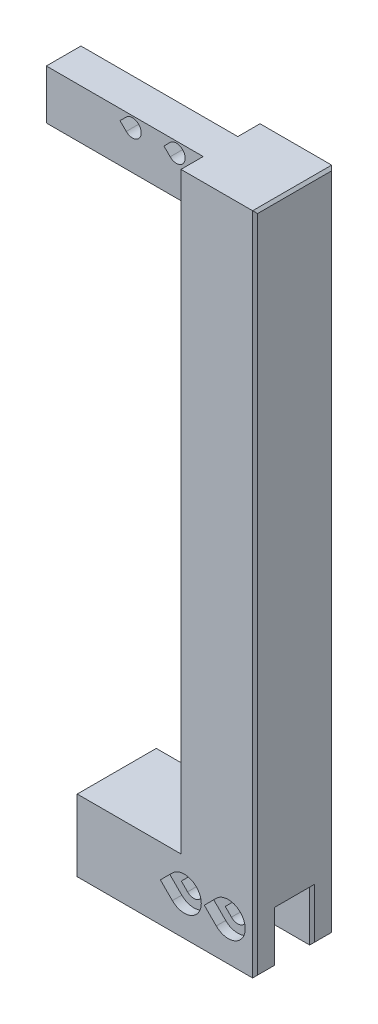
ISO-10303-21;
HEADER;
FILE_DESCRIPTION(('STEP AP214'),'2;1');
FILE_NAME('part.step','',(''),(''),'','','');
FILE_SCHEMA(('AUTOMOTIVE_DESIGN { 1 0 10303 214 1 1 1 1 }'));
ENDSEC;
DATA;
#1=APPLICATION_CONTEXT('core data for automotive mechanical design processes');
#2=APPLICATION_PROTOCOL_DEFINITION('international standard','automotive_design',2000,#1);
#3=PRODUCT_CONTEXT('',#1,'mechanical');
#4=PRODUCT('Part','Part','',(#3));
#5=PRODUCT_RELATED_PRODUCT_CATEGORY('part','',(#4));
#6=PRODUCT_DEFINITION_FORMATION('','',#4);
#7=PRODUCT_DEFINITION_CONTEXT('part definition',#1,'design');
#8=PRODUCT_DEFINITION('design','',#6,#7);
#9=PRODUCT_DEFINITION_SHAPE('','',#8);
#10=(LENGTH_UNIT() NAMED_UNIT(*) SI_UNIT(.MILLI.,.METRE.));
#11=(NAMED_UNIT(*) PLANE_ANGLE_UNIT() SI_UNIT($,.RADIAN.));
#12=(NAMED_UNIT(*) SI_UNIT($,.STERADIAN.) SOLID_ANGLE_UNIT());
#13=UNCERTAINTY_MEASURE_WITH_UNIT(LENGTH_MEASURE(1.E-05),#10,'distance_accuracy_value','');
#14=(GEOMETRIC_REPRESENTATION_CONTEXT(3) GLOBAL_UNCERTAINTY_ASSIGNED_CONTEXT((#13)) GLOBAL_UNIT_ASSIGNED_CONTEXT((#10,
#11,#12)) REPRESENTATION_CONTEXT('',''));
#15=CARTESIAN_POINT('',(0.,0.,0.));
#16=DIRECTION('',(0.,0.,1.));
#17=DIRECTION('',(1.,0.,0.));
#18=AXIS2_PLACEMENT_3D('',#15,#16,#17);
#19=CARTESIAN_POINT('',(9.28460028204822,7.87,8.));
#20=DIRECTION('',(-1.,0.,0.));
#21=DIRECTION('',(0.,0.,1.));
#22=AXIS2_PLACEMENT_3D('',#19,#20,#21);
#23=CYLINDRICAL_SURFACE('',#22,1.78);
#24=CARTESIAN_POINT('',(4.25,7.87,8.));
#25=DIRECTION('',(-1.,0.,0.));
#26=DIRECTION('',(0.,0.,1.));
#27=AXIS2_PLACEMENT_3D('',#24,#25,#26);
#28=CIRCLE('',#27,1.78);
#29=CARTESIAN_POINT('',(4.25,7.87,9.78));
#30=VERTEX_POINT('',#29);
#31=EDGE_CURVE('E468',#30,#30,#28,.F.);
#32=ORIENTED_EDGE('',*,*,#31,.T.);
#33=EDGE_LOOP('',(#32));
#34=FACE_BOUND('',#33,.T.);
#35=CARTESIAN_POINT('',(1.91,7.87,8.));
#36=DIRECTION('',(-1.,0.,0.));
#37=DIRECTION('',(0.,0.,1.));
#38=AXIS2_PLACEMENT_3D('',#35,#36,#37);
#39=CIRCLE('',#38,1.78);
#40=CARTESIAN_POINT('',(1.91,7.87,9.78));
#41=VERTEX_POINT('',#40);
#42=EDGE_CURVE('E932',#41,#41,#39,.T.);
#43=ORIENTED_EDGE('',*,*,#42,.T.);
#44=EDGE_LOOP('',(#43));
#45=FACE_BOUND('',#44,.T.);
#46=ADVANCED_FACE('F109',(#34,#45),#23,.F.);
#47=CARTESIAN_POINT('',(-10.75,134.5,4.50000000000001));
#48=DIRECTION('',(0.,0.,1.));
#49=DIRECTION('',(1.,0.,0.));
#50=AXIS2_PLACEMENT_3D('',#47,#48,#49);
#51=PLANE('',#50);
#52=DIRECTION('',(0.707106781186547,-0.707106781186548,0.));
#53=VECTOR('',#52,1.);
#54=CARTESIAN_POINT('',(68.266349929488,68.2663499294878,4.50000000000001));
#55=LINE('',#54,#53);
#56=CARTESIAN_POINT('',(4.16269985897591,132.37,4.50000000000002));
#57=VERTEX_POINT('',#56);
#58=CARTESIAN_POINT('',(5.42134992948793,131.111349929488,4.50000000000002));
#59=VERTEX_POINT('',#58);
#60=EDGE_CURVE('E467',#57,#59,#55,.T.);
#61=ORIENTED_EDGE('',*,*,#60,.T.);
#62=CARTESIAN_POINT('',(6.68,132.37,4.50000000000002));
#63=DIRECTION('',(0.,0.,-1.));
#64=DIRECTION('',(-1.,0.,0.));
#65=AXIS2_PLACEMENT_3D('',#62,#63,#64);
#66=CIRCLE('',#65,1.78);
#67=CARTESIAN_POINT('',(5.42134992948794,133.628650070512,4.50000000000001));
#68=VERTEX_POINT('',#67);
#69=EDGE_CURVE('E463',#68,#59,#66,.T.);
#70=ORIENTED_EDGE('',*,*,#69,.F.);
#71=DIRECTION('',(-0.707106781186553,-0.707106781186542,0.));
#72=VECTOR('',#71,1.);
#73=CARTESIAN_POINT('',(-64.1036500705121,64.1036500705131,4.50000000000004));
#74=LINE('',#73,#72);
#75=EDGE_CURVE('E472',#68,#57,#74,.T.);
#76=ORIENTED_EDGE('',*,*,#75,.T.);
#77=EDGE_LOOP('',(#61,#70,#76));
#78=FACE_BOUND('',#77,.T.);
#79=DIRECTION('',(0.,-1.,0.));
#80=VECTOR('',#79,1.);
#81=CARTESIAN_POINT('',(21.,134.5,4.50000000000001));
#82=LINE('',#81,#80);
#83=CARTESIAN_POINT('',(21.,134.5,4.50000000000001));
#84=VERTEX_POINT('',#83);
#85=CARTESIAN_POINT('',(21.,124.5,4.50000000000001));
#86=VERTEX_POINT('',#85);
#87=EDGE_CURVE('E504',#84,#86,#82,.T.);
#88=ORIENTED_EDGE('',*,*,#87,.T.);
#89=DIRECTION('',(1.,0.,0.));
#90=VECTOR('',#89,1.);
#91=CARTESIAN_POINT('',(-10.75,124.5,4.50000000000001));
#92=LINE('',#91,#90);
#93=CARTESIAN_POINT('',(-10.75,124.5,4.50000000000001));
#94=VERTEX_POINT('',#93);
#95=EDGE_CURVE('E524',#94,#86,#92,.T.);
#96=ORIENTED_EDGE('',*,*,#95,.F.);
#97=DIRECTION('',(0.,-1.,0.));
#98=VECTOR('',#97,1.);
#99=CARTESIAN_POINT('',(-10.75,134.5,4.50000000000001));
#100=LINE('',#99,#98);
#101=CARTESIAN_POINT('',(-10.75,134.5,4.50000000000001));
#102=VERTEX_POINT('',#101);
#103=EDGE_CURVE('E489',#102,#94,#100,.T.);
#104=ORIENTED_EDGE('',*,*,#103,.F.);
#105=DIRECTION('',(1.,0.,0.));
#106=VECTOR('',#105,1.);
#107=CARTESIAN_POINT('',(-10.75,134.5,4.50000000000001));
#108=LINE('',#107,#106);
#109=EDGE_CURVE('E503',#102,#84,#108,.T.);
#110=ORIENTED_EDGE('',*,*,#109,.T.);
#111=EDGE_LOOP('',(#88,#96,#104,#110));
#112=FACE_BOUND('',#111,.T.);
#113=DIRECTION('',(0.707106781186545,-0.70710678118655,0.));
#114=VECTOR('',#113,1.);
#115=CARTESIAN_POINT('',(72.711349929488,72.7113499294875,4.5));
#116=LINE('',#115,#114);
#117=CARTESIAN_POINT('',(13.0526998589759,132.37,4.50000000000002));
#118=VERTEX_POINT('',#117);
#119=CARTESIAN_POINT('',(14.3113499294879,131.111349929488,4.50000000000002));
#120=VERTEX_POINT('',#119);
#121=EDGE_CURVE('E422',#118,#120,#116,.T.);
#122=ORIENTED_EDGE('',*,*,#121,.T.);
#123=CARTESIAN_POINT('',(15.57,132.37,4.50000000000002));
#124=DIRECTION('',(0.,0.,-1.));
#125=DIRECTION('',(-1.,0.,0.));
#126=AXIS2_PLACEMENT_3D('',#123,#124,#125);
#127=CIRCLE('',#126,1.78);
#128=CARTESIAN_POINT('',(14.3113499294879,133.628650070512,4.50000000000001));
#129=VERTEX_POINT('',#128);
#130=EDGE_CURVE('E434',#129,#120,#127,.T.);
#131=ORIENTED_EDGE('',*,*,#130,.F.);
#132=DIRECTION('',(-0.707106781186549,-0.707106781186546,0.));
#133=VECTOR('',#132,1.);
#134=CARTESIAN_POINT('',(-59.6586500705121,59.6586500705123,4.50000000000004));
#135=LINE('',#134,#133);
#136=EDGE_CURVE('E430',#129,#118,#135,.T.);
#137=ORIENTED_EDGE('',*,*,#136,.T.);
#138=EDGE_LOOP('',(#122,#131,#137));
#139=FACE_BOUND('',#138,.T.);
#140=ADVANCED_FACE('F442',(#78,#112,#139),#51,.F.);
#141=CARTESIAN_POINT('',(-10.75,134.5,11.5));
#142=DIRECTION('',(0.,0.,-1.));
#143=DIRECTION('',(-1.,0.,0.));
#144=AXIS2_PLACEMENT_3D('',#141,#142,#143);
#145=PLANE('',#144);
#146=DIRECTION('',(-0.707106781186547,0.707106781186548,0.));
#147=VECTOR('',#146,1.);
#148=CARTESIAN_POINT('',(68.266349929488,68.2663499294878,11.5));
#149=LINE('',#148,#147);
#150=CARTESIAN_POINT('',(5.42134992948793,131.111349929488,11.5));
#151=VERTEX_POINT('',#150);
#152=CARTESIAN_POINT('',(4.16269985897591,132.37,11.5));
#153=VERTEX_POINT('',#152);
#154=EDGE_CURVE('E460',#151,#153,#149,.T.);
#155=ORIENTED_EDGE('',*,*,#154,.T.);
#156=DIRECTION('',(0.707106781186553,0.707106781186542,0.));
#157=VECTOR('',#156,1.);
#158=CARTESIAN_POINT('',(-64.1036500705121,64.1036500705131,11.5));
#159=LINE('',#158,#157);
#160=CARTESIAN_POINT('',(5.42134992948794,133.628650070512,11.5));
#161=VERTEX_POINT('',#160);
#162=EDGE_CURVE('E456',#153,#161,#159,.T.);
#163=ORIENTED_EDGE('',*,*,#162,.T.);
#164=CARTESIAN_POINT('',(6.68,132.37,11.5));
#165=DIRECTION('',(0.,0.,-1.));
#166=DIRECTION('',(-1.,0.,0.));
#167=AXIS2_PLACEMENT_3D('',#164,#165,#166);
#168=CIRCLE('',#167,1.78);
#169=EDGE_CURVE('E440',#151,#161,#168,.F.);
#170=ORIENTED_EDGE('',*,*,#169,.F.);
#171=EDGE_LOOP('',(#155,#163,#170));
#172=FACE_BOUND('',#171,.T.);
#173=DIRECTION('',(0.,1.,0.));
#174=VECTOR('',#173,1.);
#175=CARTESIAN_POINT('',(21.,134.5,11.5));
#176=LINE('',#175,#174);
#177=CARTESIAN_POINT('',(21.,124.5,11.5));
#178=VERTEX_POINT('',#177);
#179=CARTESIAN_POINT('',(21.,134.5,11.5));
#180=VERTEX_POINT('',#179);
#181=EDGE_CURVE('E494',#178,#180,#176,.T.);
#182=ORIENTED_EDGE('',*,*,#181,.T.);
#183=DIRECTION('',(1.,0.,0.));
#184=VECTOR('',#183,1.);
#185=CARTESIAN_POINT('',(-10.75,134.5,11.5));
#186=LINE('',#185,#184);
#187=CARTESIAN_POINT('',(-10.75,134.5,11.5));
#188=VERTEX_POINT('',#187);
#189=EDGE_CURVE('E517',#188,#180,#186,.T.);
#190=ORIENTED_EDGE('',*,*,#189,.F.);
#191=DIRECTION('',(0.,1.,0.));
#192=VECTOR('',#191,1.);
#193=CARTESIAN_POINT('',(-10.75,134.5,11.5));
#194=LINE('',#193,#192);
#195=CARTESIAN_POINT('',(-10.75,124.5,11.5));
#196=VERTEX_POINT('',#195);
#197=EDGE_CURVE('E497',#196,#188,#194,.T.);
#198=ORIENTED_EDGE('',*,*,#197,.F.);
#199=DIRECTION('',(1.,0.,0.));
#200=VECTOR('',#199,1.);
#201=CARTESIAN_POINT('',(-10.75,124.5,11.5));
#202=LINE('',#201,#200);
#203=EDGE_CURVE('E520',#196,#178,#202,.T.);
#204=ORIENTED_EDGE('',*,*,#203,.T.);
#205=EDGE_LOOP('',(#182,#190,#198,#204));
#206=FACE_BOUND('',#205,.T.);
#207=DIRECTION('',(-0.707106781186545,0.70710678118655,0.));
#208=VECTOR('',#207,1.);
#209=CARTESIAN_POINT('',(72.711349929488,72.7113499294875,11.5));
#210=LINE('',#209,#208);
#211=CARTESIAN_POINT('',(14.3113499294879,131.111349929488,11.5));
#212=VERTEX_POINT('',#211);
#213=CARTESIAN_POINT('',(13.0526998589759,132.37,11.5));
#214=VERTEX_POINT('',#213);
#215=EDGE_CURVE('E425',#212,#214,#210,.T.);
#216=ORIENTED_EDGE('',*,*,#215,.T.);
#217=DIRECTION('',(0.707106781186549,0.707106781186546,0.));
#218=VECTOR('',#217,1.);
#219=CARTESIAN_POINT('',(-59.6586500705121,59.6586500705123,11.5));
#220=LINE('',#219,#218);
#221=CARTESIAN_POINT('',(14.3113499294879,133.628650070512,11.5));
#222=VERTEX_POINT('',#221);
#223=EDGE_CURVE('E455',#214,#222,#220,.T.);
#224=ORIENTED_EDGE('',*,*,#223,.T.);
#225=CARTESIAN_POINT('',(15.57,132.37,11.5));
#226=DIRECTION('',(0.,0.,-1.));
#227=DIRECTION('',(-1.,0.,0.));
#228=AXIS2_PLACEMENT_3D('',#225,#226,#227);
#229=CIRCLE('',#228,1.78);
#230=EDGE_CURVE('E509',#212,#222,#229,.F.);
#231=ORIENTED_EDGE('',*,*,#230,.F.);
#232=EDGE_LOOP('',(#216,#224,#231));
#233=FACE_BOUND('',#232,.T.);
#234=ADVANCED_FACE('F951',(#172,#206,#233),#145,.F.);
#235=CARTESIAN_POINT('',(21.,134.5,0.));
#236=DIRECTION('',(1.,0.,0.));
#237=DIRECTION('',(0.,0.,-1.));
#238=AXIS2_PLACEMENT_3D('',#235,#236,#237);
#239=PLANE('',#238);
#240=ORIENTED_EDGE('',*,*,#87,.F.);
#241=DIRECTION('',(0.,0.,1.));
#242=VECTOR('',#241,1.);
#243=CARTESIAN_POINT('',(21.,134.5,0.));
#244=LINE('',#243,#242);
#245=CARTESIAN_POINT('',(21.,134.5,0.));
#246=VERTEX_POINT('',#245);
#247=EDGE_CURVE('E528',#246,#84,#244,.T.);
#248=ORIENTED_EDGE('',*,*,#247,.F.);
#249=DIRECTION('',(0.,-1.,0.));
#250=VECTOR('',#249,1.);
#251=CARTESIAN_POINT('',(21.,134.5,0.));
#252=LINE('',#251,#250);
#253=CARTESIAN_POINT('',(21.,14.5,0.));
#254=VERTEX_POINT('',#253);
#255=EDGE_CURVE('E540',#246,#254,#252,.T.);
#256=ORIENTED_EDGE('',*,*,#255,.T.);
#257=DIRECTION('',(0.,0.,1.));
#258=VECTOR('',#257,1.);
#259=CARTESIAN_POINT('',(21.,14.5,0.));
#260=LINE('',#259,#258);
#261=CARTESIAN_POINT('',(21.,14.5,16.));
#262=VERTEX_POINT('',#261);
#263=EDGE_CURVE('E527',#254,#262,#260,.T.);
#264=ORIENTED_EDGE('',*,*,#263,.T.);
#265=DIRECTION('',(0.,-1.,0.));
#266=VECTOR('',#265,1.);
#267=CARTESIAN_POINT('',(21.,134.5,16.));
#268=LINE('',#267,#266);
#269=CARTESIAN_POINT('',(21.,134.5,16.));
#270=VERTEX_POINT('',#269);
#271=EDGE_CURVE('E547',#270,#262,#268,.T.);
#272=ORIENTED_EDGE('',*,*,#271,.F.);
#273=EDGE_CURVE('E533',#180,#270,#244,.T.);
#274=ORIENTED_EDGE('',*,*,#273,.F.);
#275=ORIENTED_EDGE('',*,*,#181,.F.);
#276=DIRECTION('',(0.,0.,1.));
#277=VECTOR('',#276,1.);
#278=CARTESIAN_POINT('',(21.,124.5,4.50000000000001));
#279=LINE('',#278,#277);
#280=EDGE_CURVE('E508',#86,#178,#279,.T.);
#281=ORIENTED_EDGE('',*,*,#280,.F.);
#282=EDGE_LOOP('',(#240,#248,#256,#264,#272,#274,#275,#281));
#283=FACE_BOUND('',#282,.T.);
#284=ADVANCED_FACE('F953',(#283),#239,.F.);
#285=CARTESIAN_POINT('',(0.,14.5,16.));
#286=DIRECTION('',(0.,0.,-1.));
#287=DIRECTION('',(-1.,0.,0.));
#288=AXIS2_PLACEMENT_3D('',#285,#286,#287);
#289=PLANE('',#288);
#290=CARTESIAN_POINT('',(30.57,7.87,16.));
#291=DIRECTION('',(0.,0.,-1.));
#292=DIRECTION('',(-1.,0.,0.));
#293=AXIS2_PLACEMENT_3D('',#290,#291,#292);
#294=CIRCLE('',#293,3.43);
#295=CARTESIAN_POINT('',(28.1446237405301,10.2953762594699,16.));
#296=VERTEX_POINT('',#295);
#297=CARTESIAN_POINT('',(28.1446237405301,5.44462374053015,16.));
#298=VERTEX_POINT('',#297);
#299=EDGE_CURVE('E580',#296,#298,#294,.T.);
#300=ORIENTED_EDGE('',*,*,#299,.T.);
#301=DIRECTION('',(0.707106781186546,-0.707106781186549,0.));
#302=VECTOR('',#301,1.);
#303=CARTESIAN_POINT('',(9.54462374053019,24.0446237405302,16.));
#304=LINE('',#303,#302);
#305=CARTESIAN_POINT('',(25.7192474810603,7.87,16.));
#306=VERTEX_POINT('',#305);
#307=EDGE_CURVE('E564',#306,#298,#304,.T.);
#308=ORIENTED_EDGE('',*,*,#307,.F.);
#309=DIRECTION('',(-0.707106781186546,-0.707106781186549,0.));
#310=VECTOR('',#309,1.);
#311=CARTESIAN_POINT('',(16.1746237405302,-1.67462374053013,16.));
#312=LINE('',#311,#310);
#313=EDGE_CURVE('E570',#296,#306,#312,.T.);
#314=ORIENTED_EDGE('',*,*,#313,.F.);
#315=EDGE_LOOP('',(#300,#308,#314));
#316=FACE_BOUND('',#315,.T.);
#317=CARTESIAN_POINT('',(21.68,7.87,16.));
#318=DIRECTION('',(0.,0.,-1.));
#319=DIRECTION('',(-1.,0.,0.));
#320=AXIS2_PLACEMENT_3D('',#317,#318,#319);
#321=CIRCLE('',#320,3.43);
#322=CARTESIAN_POINT('',(19.2546237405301,10.2953762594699,16.));
#323=VERTEX_POINT('',#322);
#324=CARTESIAN_POINT('',(19.2546237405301,5.44462374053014,16.));
#325=VERTEX_POINT('',#324);
#326=EDGE_CURVE('E623',#323,#325,#321,.T.);
#327=ORIENTED_EDGE('',*,*,#326,.T.);
#328=DIRECTION('',(0.707106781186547,-0.707106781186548,0.));
#329=VECTOR('',#328,1.);
#330=CARTESIAN_POINT('',(5.09962374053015,19.5996237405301,16.));
#331=LINE('',#330,#329);
#332=CARTESIAN_POINT('',(16.8292474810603,7.87,16.));
#333=VERTEX_POINT('',#332);
#334=EDGE_CURVE('E607',#333,#325,#331,.T.);
#335=ORIENTED_EDGE('',*,*,#334,.F.);
#336=DIRECTION('',(-0.707106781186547,-0.707106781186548,0.));
#337=VECTOR('',#336,1.);
#338=CARTESIAN_POINT('',(11.7296237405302,2.77037625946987,16.));
#339=LINE('',#338,#337);
#340=EDGE_CURVE('E613',#323,#333,#339,.T.);
#341=ORIENTED_EDGE('',*,*,#340,.F.);
#342=EDGE_LOOP('',(#327,#335,#341));
#343=FACE_BOUND('',#342,.T.);
#344=DIRECTION('',(1.,0.,0.));
#345=VECTOR('',#344,1.);
#346=CARTESIAN_POINT('',(0.,0.,16.));
#347=LINE('',#346,#345);
#348=CARTESIAN_POINT('',(0.,0.,16.));
#349=VERTEX_POINT('',#348);
#350=CARTESIAN_POINT('',(35.5,0.,16.));
#351=VERTEX_POINT('',#350);
#352=EDGE_CURVE('E815',#349,#351,#347,.T.);
#353=ORIENTED_EDGE('',*,*,#352,.T.);
#354=DIRECTION('',(0.,1.,0.));
#355=VECTOR('',#354,1.);
#356=CARTESIAN_POINT('',(35.5,14.5,16.));
#357=LINE('',#356,#355);
#358=CARTESIAN_POINT('',(35.5,134.5,16.));
#359=VERTEX_POINT('',#358);
#360=EDGE_CURVE('E875',#351,#359,#357,.T.);
#361=ORIENTED_EDGE('',*,*,#360,.T.);
#362=DIRECTION('',(1.,0.,0.));
#363=VECTOR('',#362,1.);
#364=CARTESIAN_POINT('',(21.,134.5,16.));
#365=LINE('',#364,#363);
#366=EDGE_CURVE('E532',#270,#359,#365,.T.);
#367=ORIENTED_EDGE('',*,*,#366,.F.);
#368=ORIENTED_EDGE('',*,*,#271,.T.);
#369=DIRECTION('',(1.,0.,0.));
#370=VECTOR('',#369,1.);
#371=CARTESIAN_POINT('',(0.,14.5,16.));
#372=LINE('',#371,#370);
#373=CARTESIAN_POINT('',(0.,14.5,16.));
#374=VERTEX_POINT('',#373);
#375=EDGE_CURVE('E804',#374,#262,#372,.T.);
#376=ORIENTED_EDGE('',*,*,#375,.F.);
#377=DIRECTION('',(0.,-1.,0.));
#378=VECTOR('',#377,1.);
#379=CARTESIAN_POINT('',(0.,14.5,16.));
#380=LINE('',#379,#378);
#381=EDGE_CURVE('E824',#374,#349,#380,.T.);
#382=ORIENTED_EDGE('',*,*,#381,.T.);
#383=EDGE_LOOP('',(#353,#361,#367,#368,#376,#382));
#384=FACE_BOUND('',#383,.T.);
#385=ADVANCED_FACE('F961',(#316,#343,#384),#289,.F.);
#386=CARTESIAN_POINT('',(0.,14.5,0.));
#387=DIRECTION('',(0.,0.,1.));
#388=DIRECTION('',(1.,0.,0.));
#389=AXIS2_PLACEMENT_3D('',#386,#387,#388);
#390=PLANE('',#389);
#391=DIRECTION('',(0.707106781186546,-0.707106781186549,0.));
#392=VECTOR('',#391,1.);
#393=CARTESIAN_POINT('',(16.7946237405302,16.7946237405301,0.));
#394=LINE('',#393,#392);
#395=CARTESIAN_POINT('',(25.7192474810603,7.87,0.));
#396=VERTEX_POINT('',#395);
#397=CARTESIAN_POINT('',(28.1446237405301,5.44462374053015,0.));
#398=VERTEX_POINT('',#397);
#399=EDGE_CURVE('E644',#396,#398,#394,.T.);
#400=ORIENTED_EDGE('',*,*,#399,.T.);
#401=CARTESIAN_POINT('',(30.57,7.87,0.));
#402=DIRECTION('',(0.,0.,-1.));
#403=DIRECTION('',(-1.,0.,0.));
#404=AXIS2_PLACEMENT_3D('',#401,#402,#403);
#405=CIRCLE('',#404,3.43);
#406=CARTESIAN_POINT('',(28.1446237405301,10.2953762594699,0.));
#407=VERTEX_POINT('',#406);
#408=EDGE_CURVE('E648',#407,#398,#405,.T.);
#409=ORIENTED_EDGE('',*,*,#408,.F.);
#410=DIRECTION('',(-0.707106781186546,-0.707106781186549,0.));
#411=VECTOR('',#410,1.);
#412=CARTESIAN_POINT('',(8.92462374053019,-8.92462374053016,0.));
#413=LINE('',#412,#411);
#414=EDGE_CURVE('E638',#407,#396,#413,.T.);
#415=ORIENTED_EDGE('',*,*,#414,.T.);
#416=EDGE_LOOP('',(#400,#409,#415));
#417=FACE_BOUND('',#416,.T.);
#418=DIRECTION('',(0.707106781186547,-0.707106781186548,0.));
#419=VECTOR('',#418,1.);
#420=CARTESIAN_POINT('',(12.3496237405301,12.3496237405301,0.));
#421=LINE('',#420,#419);
#422=CARTESIAN_POINT('',(16.8292474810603,7.87,0.));
#423=VERTEX_POINT('',#422);
#424=CARTESIAN_POINT('',(19.2546237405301,5.44462374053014,0.));
#425=VERTEX_POINT('',#424);
#426=EDGE_CURVE('E689',#423,#425,#421,.T.);
#427=ORIENTED_EDGE('',*,*,#426,.T.);
#428=CARTESIAN_POINT('',(21.68,7.87,0.));
#429=DIRECTION('',(0.,0.,-1.));
#430=DIRECTION('',(-1.,0.,0.));
#431=AXIS2_PLACEMENT_3D('',#428,#429,#430);
#432=CIRCLE('',#431,3.43);
#433=CARTESIAN_POINT('',(19.2546237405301,10.2953762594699,0.));
#434=VERTEX_POINT('',#433);
#435=EDGE_CURVE('E693',#434,#425,#432,.T.);
#436=ORIENTED_EDGE('',*,*,#435,.F.);
#437=DIRECTION('',(-0.707106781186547,-0.707106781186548,0.));
#438=VECTOR('',#437,1.);
#439=CARTESIAN_POINT('',(4.47962374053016,-4.47962374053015,0.));
#440=LINE('',#439,#438);
#441=EDGE_CURVE('E683',#434,#423,#440,.T.);
#442=ORIENTED_EDGE('',*,*,#441,.T.);
#443=EDGE_LOOP('',(#427,#436,#442));
#444=FACE_BOUND('',#443,.T.);
#445=DIRECTION('',(-1.,0.,0.));
#446=VECTOR('',#445,1.);
#447=CARTESIAN_POINT('',(21.,134.5,0.));
#448=LINE('',#447,#446);
#449=CARTESIAN_POINT('',(35.5,134.5,0.));
#450=VERTEX_POINT('',#449);
#451=EDGE_CURVE('E537',#450,#246,#448,.T.);
#452=ORIENTED_EDGE('',*,*,#451,.F.);
#453=DIRECTION('',(0.,-1.,0.));
#454=VECTOR('',#453,1.);
#455=CARTESIAN_POINT('',(35.5,14.5,0.));
#456=LINE('',#455,#454);
#457=CARTESIAN_POINT('',(35.5,0.,0.));
#458=VERTEX_POINT('',#457);
#459=EDGE_CURVE('E882',#450,#458,#456,.T.);
#460=ORIENTED_EDGE('',*,*,#459,.T.);
#461=DIRECTION('',(-1.,0.,0.));
#462=VECTOR('',#461,1.);
#463=CARTESIAN_POINT('',(0.,0.,0.));
#464=LINE('',#463,#462);
#465=CARTESIAN_POINT('',(0.,0.,0.));
#466=VERTEX_POINT('',#465);
#467=EDGE_CURVE('E805',#458,#466,#464,.T.);
#468=ORIENTED_EDGE('',*,*,#467,.T.);
#469=DIRECTION('',(0.,-1.,0.));
#470=VECTOR('',#469,1.);
#471=CARTESIAN_POINT('',(0.,14.5,0.));
#472=LINE('',#471,#470);
#473=CARTESIAN_POINT('',(0.,14.5,0.));
#474=VERTEX_POINT('',#473);
#475=EDGE_CURVE('E811',#474,#466,#472,.T.);
#476=ORIENTED_EDGE('',*,*,#475,.F.);
#477=DIRECTION('',(-1.,0.,0.));
#478=VECTOR('',#477,1.);
#479=CARTESIAN_POINT('',(0.,14.5,0.));
#480=LINE('',#479,#478);
#481=EDGE_CURVE('E808',#254,#474,#480,.T.);
#482=ORIENTED_EDGE('',*,*,#481,.F.);
#483=ORIENTED_EDGE('',*,*,#255,.F.);
#484=EDGE_LOOP('',(#452,#460,#468,#476,#482,#483));
#485=FACE_BOUND('',#484,.T.);
#486=ADVANCED_FACE('F1117',(#417,#444,#485),#390,.F.);
#487=CARTESIAN_POINT('',(4.25,0.,11.55));
#488=DIRECTION('',(0.,0.,1.));
#489=DIRECTION('',(1.,0.,0.));
#490=AXIS2_PLACEMENT_3D('',#487,#488,#489);
#491=PLANE('',#490);
#492=DIRECTION('',(0.707106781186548,0.707106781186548,0.));
#493=VECTOR('',#492,1.);
#494=CARTESIAN_POINT('',(12.2163499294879,-7.96634992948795,11.55));
#495=LINE('',#494,#493);
#496=CARTESIAN_POINT('',(28.0526998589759,7.87,11.55));
#497=VERTEX_POINT('',#496);
#498=CARTESIAN_POINT('',(29.3113499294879,9.12865007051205,11.55));
#499=VERTEX_POINT('',#498);
#500=EDGE_CURVE('E755',#497,#499,#495,.T.);
#501=ORIENTED_EDGE('',*,*,#500,.F.);
#502=DIRECTION('',(-0.707106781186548,0.707106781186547,0.));
#503=VECTOR('',#502,1.);
#504=CARTESIAN_POINT('',(20.0863499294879,15.836349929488,11.55));
#505=LINE('',#504,#503);
#506=CARTESIAN_POINT('',(29.3113499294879,6.61134992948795,11.55));
#507=VERTEX_POINT('',#506);
#508=EDGE_CURVE('E751',#507,#497,#505,.T.);
#509=ORIENTED_EDGE('',*,*,#508,.F.);
#510=CARTESIAN_POINT('',(30.57,7.87,11.55));
#511=DIRECTION('',(0.,0.,1.));
#512=DIRECTION('',(1.,0.,0.));
#513=AXIS2_PLACEMENT_3D('',#510,#511,#512);
#514=CIRCLE('',#513,1.78);
#515=EDGE_CURVE('E727',#507,#499,#514,.T.);
#516=ORIENTED_EDGE('',*,*,#515,.T.);
#517=EDGE_LOOP('',(#501,#509,#516));
#518=FACE_BOUND('',#517,.T.);
#519=DIRECTION('',(1.,0.,0.));
#520=VECTOR('',#519,1.);
#521=CARTESIAN_POINT('',(4.25,10.16,11.55));
#522=LINE('',#521,#520);
#523=CARTESIAN_POINT('',(4.25,10.16,11.55));
#524=VERTEX_POINT('',#523);
#525=CARTESIAN_POINT('',(35.5,10.16,11.55));
#526=VERTEX_POINT('',#525);
#527=EDGE_CURVE('E787',#524,#526,#522,.T.);
#528=ORIENTED_EDGE('',*,*,#527,.T.);
#529=DIRECTION('',(0.,-1.,0.));
#530=VECTOR('',#529,1.);
#531=CARTESIAN_POINT('',(35.5,0.,11.55));
#532=LINE('',#531,#530);
#533=CARTESIAN_POINT('',(35.5,0.,11.55));
#534=VERTEX_POINT('',#533);
#535=EDGE_CURVE('E13',#526,#534,#532,.T.);
#536=ORIENTED_EDGE('',*,*,#535,.T.);
#537=DIRECTION('',(1.,0.,0.));
#538=VECTOR('',#537,1.);
#539=CARTESIAN_POINT('',(4.25,0.,11.55));
#540=LINE('',#539,#538);
#541=CARTESIAN_POINT('',(4.25,0.,11.55));
#542=VERTEX_POINT('',#541);
#543=EDGE_CURVE('E786',#542,#534,#540,.T.);
#544=ORIENTED_EDGE('',*,*,#543,.F.);
#545=DIRECTION('',(0.,-1.,0.));
#546=VECTOR('',#545,1.);
#547=CARTESIAN_POINT('',(4.25,0.,11.55));
#548=LINE('',#547,#546);
#549=EDGE_CURVE('E771',#524,#542,#548,.T.);
#550=ORIENTED_EDGE('',*,*,#549,.F.);
#551=EDGE_LOOP('',(#528,#536,#544,#550));
#552=FACE_BOUND('',#551,.T.);
#553=DIRECTION('',(0.707106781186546,0.70710678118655,0.));
#554=VECTOR('',#553,1.);
#555=CARTESIAN_POINT('',(7.77134992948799,-3.52134992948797,11.55));
#556=LINE('',#555,#554);
#557=CARTESIAN_POINT('',(19.1626998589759,7.87,11.55));
#558=VERTEX_POINT('',#557);
#559=CARTESIAN_POINT('',(20.4213499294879,9.12865007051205,11.55));
#560=VERTEX_POINT('',#559);
#561=EDGE_CURVE('E767',#558,#560,#556,.T.);
#562=ORIENTED_EDGE('',*,*,#561,.F.);
#563=DIRECTION('',(-0.707106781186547,0.707106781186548,0.));
#564=VECTOR('',#563,1.);
#565=CARTESIAN_POINT('',(15.641349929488,11.3913499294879,11.55));
#566=LINE('',#565,#564);
#567=CARTESIAN_POINT('',(20.4213499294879,6.61134992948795,11.55));
#568=VERTEX_POINT('',#567);
#569=EDGE_CURVE('E763',#568,#558,#566,.T.);
#570=ORIENTED_EDGE('',*,*,#569,.F.);
#571=CARTESIAN_POINT('',(21.68,7.87,11.55));
#572=DIRECTION('',(0.,0.,1.));
#573=DIRECTION('',(1.,0.,0.));
#574=AXIS2_PLACEMENT_3D('',#571,#572,#573);
#575=CIRCLE('',#574,1.78);
#576=EDGE_CURVE('E759',#568,#560,#575,.T.);
#577=ORIENTED_EDGE('',*,*,#576,.T.);
#578=EDGE_LOOP('',(#562,#570,#577));
#579=FACE_BOUND('',#578,.T.);
#580=ADVANCED_FACE('F1113',(#518,#552,#579),#491,.F.);
#581=CARTESIAN_POINT('',(4.25,0.,4.45));
#582=DIRECTION('',(0.,0.,-1.));
#583=DIRECTION('',(0.,1.,0.));
#584=AXIS2_PLACEMENT_3D('',#581,#582,#583);
#585=PLANE('',#584);
#586=DIRECTION('',(-0.707106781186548,-0.707106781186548,0.));
#587=VECTOR('',#586,1.);
#588=CARTESIAN_POINT('',(12.2163499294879,-7.96634992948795,4.45));
#589=LINE('',#588,#587);
#590=CARTESIAN_POINT('',(29.3113499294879,9.12865007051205,4.45));
#591=VERTEX_POINT('',#590);
#592=CARTESIAN_POINT('',(28.0526998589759,7.87,4.45));
#593=VERTEX_POINT('',#592);
#594=EDGE_CURVE('E836',#591,#593,#589,.T.);
#595=ORIENTED_EDGE('',*,*,#594,.F.);
#596=CARTESIAN_POINT('',(30.57,7.87,4.45));
#597=DIRECTION('',(0.,0.,-1.));
#598=DIRECTION('',(0.,1.,0.));
#599=AXIS2_PLACEMENT_3D('',#596,#597,#598);
#600=CIRCLE('',#599,1.78);
#601=CARTESIAN_POINT('',(29.3113499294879,6.61134992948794,4.45));
#602=VERTEX_POINT('',#601);
#603=EDGE_CURVE('E828',#591,#602,#600,.T.);
#604=ORIENTED_EDGE('',*,*,#603,.T.);
#605=DIRECTION('',(0.707106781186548,-0.707106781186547,0.));
#606=VECTOR('',#605,1.);
#607=CARTESIAN_POINT('',(20.0863499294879,15.836349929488,4.45));
#608=LINE('',#607,#606);
#609=EDGE_CURVE('E832',#593,#602,#608,.T.);
#610=ORIENTED_EDGE('',*,*,#609,.F.);
#611=EDGE_LOOP('',(#595,#604,#610));
#612=FACE_BOUND('',#611,.T.);
#613=DIRECTION('',(1.,0.,0.));
#614=VECTOR('',#613,1.);
#615=CARTESIAN_POINT('',(4.25,0.,4.45));
#616=LINE('',#615,#614);
#617=CARTESIAN_POINT('',(4.25,0.,4.45));
#618=VERTEX_POINT('',#617);
#619=CARTESIAN_POINT('',(35.5,0.,4.45));
#620=VERTEX_POINT('',#619);
#621=EDGE_CURVE('E794',#618,#620,#616,.T.);
#622=ORIENTED_EDGE('',*,*,#621,.T.);
#623=DIRECTION('',(0.,1.,0.));
#624=VECTOR('',#623,1.);
#625=CARTESIAN_POINT('',(35.5,0.,4.45));
#626=LINE('',#625,#624);
#627=CARTESIAN_POINT('',(35.5,10.16,4.45));
#628=VERTEX_POINT('',#627);
#629=EDGE_CURVE('E135',#620,#628,#626,.T.);
#630=ORIENTED_EDGE('',*,*,#629,.T.);
#631=DIRECTION('',(1.,0.,0.));
#632=VECTOR('',#631,1.);
#633=CARTESIAN_POINT('',(4.25,10.16,4.45));
#634=LINE('',#633,#632);
#635=CARTESIAN_POINT('',(4.25,10.16,4.45));
#636=VERTEX_POINT('',#635);
#637=EDGE_CURVE('E791',#636,#628,#634,.T.);
#638=ORIENTED_EDGE('',*,*,#637,.F.);
#639=DIRECTION('',(0.,1.,0.));
#640=VECTOR('',#639,1.);
#641=CARTESIAN_POINT('',(4.25,0.,4.45));
#642=LINE('',#641,#640);
#643=EDGE_CURVE('E778',#618,#636,#642,.T.);
#644=ORIENTED_EDGE('',*,*,#643,.F.);
#645=EDGE_LOOP('',(#622,#630,#638,#644));
#646=FACE_BOUND('',#645,.T.);
#647=DIRECTION('',(-0.707106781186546,-0.70710678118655,0.));
#648=VECTOR('',#647,1.);
#649=CARTESIAN_POINT('',(7.77134992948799,-3.52134992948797,4.45));
#650=LINE('',#649,#648);
#651=CARTESIAN_POINT('',(20.4213499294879,9.12865007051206,4.45));
#652=VERTEX_POINT('',#651);
#653=CARTESIAN_POINT('',(19.1626998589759,7.87,4.45));
#654=VERTEX_POINT('',#653);
#655=EDGE_CURVE('E847',#652,#654,#650,.T.);
#656=ORIENTED_EDGE('',*,*,#655,.F.);
#657=CARTESIAN_POINT('',(21.68,7.87,4.45));
#658=DIRECTION('',(0.,0.,-1.));
#659=DIRECTION('',(0.,1.,0.));
#660=AXIS2_PLACEMENT_3D('',#657,#658,#659);
#661=CIRCLE('',#660,1.78);
#662=CARTESIAN_POINT('',(20.4213499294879,6.61134992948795,4.45));
#663=VERTEX_POINT('',#662);
#664=EDGE_CURVE('E839',#652,#663,#661,.T.);
#665=ORIENTED_EDGE('',*,*,#664,.T.);
#666=DIRECTION('',(0.707106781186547,-0.707106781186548,0.));
#667=VECTOR('',#666,1.);
#668=CARTESIAN_POINT('',(15.641349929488,11.3913499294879,4.45));
#669=LINE('',#668,#667);
#670=EDGE_CURVE('E843',#654,#663,#669,.T.);
#671=ORIENTED_EDGE('',*,*,#670,.F.);
#672=EDGE_LOOP('',(#656,#665,#671));
#673=FACE_BOUND('',#672,.T.);
#674=ADVANCED_FACE('F1051',(#612,#646,#673),#585,.F.);
#675=CARTESIAN_POINT('',(0.,14.5,0.));
#676=DIRECTION('',(1.,0.,0.));
#677=DIRECTION('',(0.,0.,-1.));
#678=AXIS2_PLACEMENT_3D('',#675,#676,#677);
#679=PLANE('',#678);
#680=CARTESIAN_POINT('',(0.,7.87,8.));
#681=DIRECTION('',(-1.,0.,0.));
#682=DIRECTION('',(0.,0.,1.));
#683=AXIS2_PLACEMENT_3D('',#680,#681,#682);
#684=CIRCLE('',#683,3.43);
#685=CARTESIAN_POINT('',(0.,7.87,11.43));
#686=VERTEX_POINT('',#685);
#687=EDGE_CURVE('E925',#686,#686,#684,.T.);
#688=ORIENTED_EDGE('',*,*,#687,.F.);
#689=EDGE_LOOP('',(#688));
#690=FACE_BOUND('',#689,.T.);
#691=DIRECTION('',(0.,0.,1.));
#692=VECTOR('',#691,1.);
#693=CARTESIAN_POINT('',(0.,0.,0.));
#694=LINE('',#693,#692);
#695=EDGE_CURVE('E790',#466,#349,#694,.T.);
#696=ORIENTED_EDGE('',*,*,#695,.T.);
#697=ORIENTED_EDGE('',*,*,#381,.F.);
#698=DIRECTION('',(0.,0.,1.));
#699=VECTOR('',#698,1.);
#700=CARTESIAN_POINT('',(0.,14.5,0.));
#701=LINE('',#700,#699);
#702=EDGE_CURVE('E800',#474,#374,#701,.T.);
#703=ORIENTED_EDGE('',*,*,#702,.F.);
#704=ORIENTED_EDGE('',*,*,#475,.T.);
#705=EDGE_LOOP('',(#696,#697,#703,#704));
#706=FACE_BOUND('',#705,.T.);
#707=ADVANCED_FACE('F1112',(#690,#706),#679,.F.);
#708=CARTESIAN_POINT('',(36.,14.5,0.));
#709=DIRECTION('',(-1.,0.,0.));
#710=DIRECTION('',(0.,0.,1.));
#711=AXIS2_PLACEMENT_3D('',#708,#709,#710);
#712=PLANE('',#711);
#713=DIRECTION('',(0.,0.,1.));
#714=VECTOR('',#713,1.);
#715=CARTESIAN_POINT('',(36.,134.,16.));
#716=LINE('',#715,#714);
#717=CARTESIAN_POINT('',(36.,134.,0.500000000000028));
#718=VERTEX_POINT('',#717);
#719=CARTESIAN_POINT('',(36.,134.,15.5));
#720=VERTEX_POINT('',#719);
#721=EDGE_CURVE('E868',#718,#720,#716,.T.);
#722=ORIENTED_EDGE('',*,*,#721,.T.);
#723=DIRECTION('',(0.,-1.,0.));
#724=VECTOR('',#723,1.);
#725=CARTESIAN_POINT('',(36.,14.5,15.5));
#726=LINE('',#725,#724);
#727=CARTESIAN_POINT('',(36.,0.500000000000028,15.5));
#728=VERTEX_POINT('',#727);
#729=EDGE_CURVE('E871',#720,#728,#726,.T.);
#730=ORIENTED_EDGE('',*,*,#729,.T.);
#731=DIRECTION('',(0.,0.,-1.));
#732=VECTOR('',#731,1.);
#733=CARTESIAN_POINT('',(36.,0.500000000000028,0.));
#734=LINE('',#733,#732);
#735=CARTESIAN_POINT('',(36.,0.500000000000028,12.05));
#736=VERTEX_POINT('',#735);
#737=EDGE_CURVE('E850',#728,#736,#734,.T.);
#738=ORIENTED_EDGE('',*,*,#737,.T.);
#739=DIRECTION('',(0.,1.,0.));
#740=VECTOR('',#739,1.);
#741=CARTESIAN_POINT('',(36.,14.5,12.05));
#742=LINE('',#741,#740);
#743=CARTESIAN_POINT('',(36.,10.66,12.05));
#744=VERTEX_POINT('',#743);
#745=EDGE_CURVE('E853',#736,#744,#742,.T.);
#746=ORIENTED_EDGE('',*,*,#745,.T.);
#747=DIRECTION('',(0.,0.,-1.));
#748=VECTOR('',#747,1.);
#749=CARTESIAN_POINT('',(36.,10.66,0.));
#750=LINE('',#749,#748);
#751=CARTESIAN_POINT('',(36.,10.66,3.94999999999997));
#752=VERTEX_POINT('',#751);
#753=EDGE_CURVE('E856',#744,#752,#750,.T.);
#754=ORIENTED_EDGE('',*,*,#753,.T.);
#755=DIRECTION('',(0.,-1.,0.));
#756=VECTOR('',#755,1.);
#757=CARTESIAN_POINT('',(36.,14.5,3.94999999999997));
#758=LINE('',#757,#756);
#759=CARTESIAN_POINT('',(36.,0.500000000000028,3.94999999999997));
#760=VERTEX_POINT('',#759);
#761=EDGE_CURVE('E859',#752,#760,#758,.T.);
#762=ORIENTED_EDGE('',*,*,#761,.T.);
#763=DIRECTION('',(0.,0.,-1.));
#764=VECTOR('',#763,1.);
#765=CARTESIAN_POINT('',(36.,0.500000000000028,0.));
#766=LINE('',#765,#764);
#767=CARTESIAN_POINT('',(36.,0.500000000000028,0.500000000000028));
#768=VERTEX_POINT('',#767);
#769=EDGE_CURVE('E862',#760,#768,#766,.T.);
#770=ORIENTED_EDGE('',*,*,#769,.T.);
#771=DIRECTION('',(0.,1.,0.));
#772=VECTOR('',#771,1.);
#773=CARTESIAN_POINT('',(36.,14.5,0.500000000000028));
#774=LINE('',#773,#772);
#775=EDGE_CURVE('E865',#768,#718,#774,.T.);
#776=ORIENTED_EDGE('',*,*,#775,.T.);
#777=EDGE_LOOP('',(#722,#730,#738,#746,#754,#762,#770,#776));
#778=FACE_BOUND('',#777,.T.);
#779=ADVANCED_FACE('F1122',(#778),#712,.F.);
#780=CARTESIAN_POINT('',(0.,14.5,0.));
#781=DIRECTION('',(0.,1.,0.));
#782=DIRECTION('',(0.,0.,1.));
#783=AXIS2_PLACEMENT_3D('',#780,#781,#782);
#784=PLANE('',#783);
#785=ORIENTED_EDGE('',*,*,#263,.F.);
#786=ORIENTED_EDGE('',*,*,#481,.T.);
#787=ORIENTED_EDGE('',*,*,#702,.T.);
#788=ORIENTED_EDGE('',*,*,#375,.T.);
#789=EDGE_LOOP('',(#785,#786,#787,#788));
#790=FACE_BOUND('',#789,.T.);
#791=ADVANCED_FACE('F1119',(#790),#784,.T.);
#792=CARTESIAN_POINT('',(0.,0.,0.));
#793=DIRECTION('',(0.,1.,0.));
#794=DIRECTION('',(0.,0.,1.));
#795=AXIS2_PLACEMENT_3D('',#792,#793,#794);
#796=PLANE('',#795);
#797=ORIENTED_EDGE('',*,*,#467,.F.);
#798=DIRECTION('',(0.,0.,1.));
#799=VECTOR('',#798,1.);
#800=CARTESIAN_POINT('',(35.5,0.,0.));
#801=LINE('',#800,#799);
#802=EDGE_CURVE('E888',#458,#620,#801,.T.);
#803=ORIENTED_EDGE('',*,*,#802,.T.);
#804=ORIENTED_EDGE('',*,*,#621,.F.);
#805=DIRECTION('',(0.,0.,-1.));
#806=VECTOR('',#805,1.);
#807=CARTESIAN_POINT('',(4.25,0.,11.55));
#808=LINE('',#807,#806);
#809=EDGE_CURVE('E774',#542,#618,#808,.T.);
#810=ORIENTED_EDGE('',*,*,#809,.F.);
#811=ORIENTED_EDGE('',*,*,#543,.T.);
#812=DIRECTION('',(0.,0.,1.));
#813=VECTOR('',#812,1.);
#814=CARTESIAN_POINT('',(35.5,0.,0.));
#815=LINE('',#814,#813);
#816=EDGE_CURVE('E885',#534,#351,#815,.T.);
#817=ORIENTED_EDGE('',*,*,#816,.T.);
#818=ORIENTED_EDGE('',*,*,#352,.F.);
#819=ORIENTED_EDGE('',*,*,#695,.F.);
#820=EDGE_LOOP('',(#797,#803,#804,#810,#811,#817,#818,#819));
#821=FACE_BOUND('',#820,.T.);
#822=ADVANCED_FACE('F1109',(#821),#796,.F.);
#823=CARTESIAN_POINT('',(4.25,10.16,11.55));
#824=DIRECTION('',(0.,1.,0.));
#825=DIRECTION('',(0.,0.,1.));
#826=AXIS2_PLACEMENT_3D('',#823,#824,#825);
#827=PLANE('',#826);
#828=ORIENTED_EDGE('',*,*,#637,.T.);
#829=DIRECTION('',(0.,0.,1.));
#830=VECTOR('',#829,1.);
#831=CARTESIAN_POINT('',(35.5,10.16,11.55));
#832=LINE('',#831,#830);
#833=EDGE_CURVE('E120',#628,#526,#832,.T.);
#834=ORIENTED_EDGE('',*,*,#833,.T.);
#835=ORIENTED_EDGE('',*,*,#527,.F.);
#836=DIRECTION('',(0.,0.,1.));
#837=VECTOR('',#836,1.);
#838=CARTESIAN_POINT('',(4.25,10.16,11.55));
#839=LINE('',#838,#837);
#840=EDGE_CURVE('E782',#636,#524,#839,.T.);
#841=ORIENTED_EDGE('',*,*,#840,.F.);
#842=EDGE_LOOP('',(#828,#834,#835,#841));
#843=FACE_BOUND('',#842,.T.);
#844=ADVANCED_FACE('F1105',(#843),#827,.F.);
#845=CARTESIAN_POINT('',(4.25,0.,0.));
#846=DIRECTION('',(-1.,0.,0.));
#847=DIRECTION('',(0.,0.,1.));
#848=AXIS2_PLACEMENT_3D('',#845,#846,#847);
#849=PLANE('',#848);
#850=ORIENTED_EDGE('',*,*,#31,.F.);
#851=EDGE_LOOP('',(#850));
#852=FACE_BOUND('',#851,.T.);
#853=ORIENTED_EDGE('',*,*,#549,.T.);
#854=ORIENTED_EDGE('',*,*,#809,.T.);
#855=ORIENTED_EDGE('',*,*,#643,.T.);
#856=ORIENTED_EDGE('',*,*,#840,.T.);
#857=EDGE_LOOP('',(#853,#854,#855,#856));
#858=FACE_BOUND('',#857,.T.);
#859=ADVANCED_FACE('F1103',(#852,#858),#849,.F.);
#860=CARTESIAN_POINT('',(30.57,7.87,16.));
#861=DIRECTION('',(0.,0.,-1.));
#862=DIRECTION('',(-1.,0.,0.));
#863=AXIS2_PLACEMENT_3D('',#860,#861,#862);
#864=CYLINDRICAL_SURFACE('',#863,1.78);
#865=DIRECTION('',(0.,0.,-1.));
#866=VECTOR('',#865,1.);
#867=CARTESIAN_POINT('',(29.3113499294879,9.12865007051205,16.));
#868=LINE('',#867,#866);
#869=CARTESIAN_POINT('',(29.3113499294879,9.12865007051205,1.91));
#870=VERTEX_POINT('',#869);
#871=EDGE_CURVE('E670',#591,#870,#868,.T.);
#872=ORIENTED_EDGE('',*,*,#871,.T.);
#873=CARTESIAN_POINT('',(30.57,7.87,1.91));
#874=DIRECTION('',(0.,0.,1.));
#875=DIRECTION('',(1.,0.,0.));
#876=AXIS2_PLACEMENT_3D('',#873,#874,#875);
#877=CIRCLE('',#876,1.78);
#878=CARTESIAN_POINT('',(29.3113499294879,6.61134992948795,1.91));
#879=VERTEX_POINT('',#878);
#880=EDGE_CURVE('E666',#870,#879,#877,.F.);
#881=ORIENTED_EDGE('',*,*,#880,.T.);
#882=DIRECTION('',(0.,0.,-1.));
#883=VECTOR('',#882,1.);
#884=CARTESIAN_POINT('',(29.3113499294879,6.61134992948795,16.));
#885=LINE('',#884,#883);
#886=EDGE_CURVE('E740',#602,#879,#885,.T.);
#887=ORIENTED_EDGE('',*,*,#886,.F.);
#888=ORIENTED_EDGE('',*,*,#603,.F.);
#889=EDGE_LOOP('',(#872,#881,#887,#888));
#890=FACE_BOUND('',#889,.T.);
#891=ADVANCED_FACE('F1093',(#890),#864,.F.);
#892=CARTESIAN_POINT('',(17.9613499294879,17.9613499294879,16.));
#893=DIRECTION('',(0.707106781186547,0.707106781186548,0.));
#894=DIRECTION('',(-0.707106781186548,0.707106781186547,0.));
#895=AXIS2_PLACEMENT_3D('',#892,#893,#894);
#896=PLANE('',#895);
#897=DIRECTION('',(0.707106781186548,-0.707106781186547,0.));
#898=VECTOR('',#897,1.);
#899=CARTESIAN_POINT('',(17.9613499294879,17.9613499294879,1.91));
#900=LINE('',#899,#898);
#901=CARTESIAN_POINT('',(28.0526998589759,7.87,1.91));
#902=VERTEX_POINT('',#901);
#903=EDGE_CURVE('E642',#902,#879,#900,.T.);
#904=ORIENTED_EDGE('',*,*,#903,.F.);
#905=DIRECTION('',(0.,0.,-1.));
#906=VECTOR('',#905,1.);
#907=CARTESIAN_POINT('',(28.0526998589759,7.87,16.));
#908=LINE('',#907,#906);
#909=EDGE_CURVE('E744',#593,#902,#908,.T.);
#910=ORIENTED_EDGE('',*,*,#909,.F.);
#911=ORIENTED_EDGE('',*,*,#609,.T.);
#912=ORIENTED_EDGE('',*,*,#886,.T.);
#913=EDGE_LOOP('',(#904,#910,#911,#912));
#914=FACE_BOUND('',#913,.T.);
#915=ADVANCED_FACE('F1098',(#914),#896,.T.);
#916=CARTESIAN_POINT('',(10.0913499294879,-10.0913499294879,16.));
#917=DIRECTION('',(0.707106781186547,-0.707106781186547,0.));
#918=DIRECTION('',(0.707106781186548,0.707106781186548,0.));
#919=AXIS2_PLACEMENT_3D('',#916,#917,#918);
#920=PLANE('',#919);
#921=DIRECTION('',(-0.707106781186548,-0.707106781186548,0.));
#922=VECTOR('',#921,1.);
#923=CARTESIAN_POINT('',(10.0913499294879,-10.0913499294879,1.91));
#924=LINE('',#923,#922);
#925=EDGE_CURVE('E653',#870,#902,#924,.T.);
#926=ORIENTED_EDGE('',*,*,#925,.F.);
#927=ORIENTED_EDGE('',*,*,#871,.F.);
#928=ORIENTED_EDGE('',*,*,#594,.T.);
#929=ORIENTED_EDGE('',*,*,#909,.T.);
#930=EDGE_LOOP('',(#926,#927,#928,#929));
#931=FACE_BOUND('',#930,.T.);
#932=ADVANCED_FACE('F1102',(#931),#920,.T.);
#933=CARTESIAN_POINT('',(21.68,7.87,16.));
#934=DIRECTION('',(0.,0.,-1.));
#935=DIRECTION('',(-1.,0.,0.));
#936=AXIS2_PLACEMENT_3D('',#933,#934,#935);
#937=CYLINDRICAL_SURFACE('',#936,1.78);
#938=DIRECTION('',(0.,0.,-1.));
#939=VECTOR('',#938,1.);
#940=CARTESIAN_POINT('',(20.4213499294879,9.12865007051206,16.));
#941=LINE('',#940,#939);
#942=CARTESIAN_POINT('',(20.4213499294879,9.12865007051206,1.91));
#943=VERTEX_POINT('',#942);
#944=EDGE_CURVE('E728',#652,#943,#941,.T.);
#945=ORIENTED_EDGE('',*,*,#944,.T.);
#946=CARTESIAN_POINT('',(21.68,7.87,1.91));
#947=DIRECTION('',(0.,0.,1.));
#948=DIRECTION('',(1.,0.,0.));
#949=AXIS2_PLACEMENT_3D('',#946,#947,#948);
#950=CIRCLE('',#949,1.78);
#951=CARTESIAN_POINT('',(20.4213499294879,6.61134992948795,1.91));
#952=VERTEX_POINT('',#951);
#953=EDGE_CURVE('E665',#943,#952,#950,.F.);
#954=ORIENTED_EDGE('',*,*,#953,.T.);
#955=DIRECTION('',(0.,0.,-1.));
#956=VECTOR('',#955,1.);
#957=CARTESIAN_POINT('',(20.4213499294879,6.61134992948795,16.));
#958=LINE('',#957,#956);
#959=EDGE_CURVE('E736',#663,#952,#958,.T.);
#960=ORIENTED_EDGE('',*,*,#959,.F.);
#961=ORIENTED_EDGE('',*,*,#664,.F.);
#962=EDGE_LOOP('',(#945,#954,#960,#961));
#963=FACE_BOUND('',#962,.T.);
#964=ADVANCED_FACE('F1043',(#963),#937,.F.);
#965=CARTESIAN_POINT('',(13.516349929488,13.5163499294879,16.));
#966=DIRECTION('',(0.707106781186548,0.707106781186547,0.));
#967=DIRECTION('',(-0.707106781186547,0.707106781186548,0.));
#968=AXIS2_PLACEMENT_3D('',#965,#966,#967);
#969=PLANE('',#968);
#970=DIRECTION('',(0.707106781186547,-0.707106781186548,0.));
#971=VECTOR('',#970,1.);
#972=CARTESIAN_POINT('',(13.516349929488,13.5163499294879,1.91));
#973=LINE('',#972,#971);
#974=CARTESIAN_POINT('',(19.1626998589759,7.87,1.91));
#975=VERTEX_POINT('',#974);
#976=EDGE_CURVE('E687',#975,#952,#973,.T.);
#977=ORIENTED_EDGE('',*,*,#976,.F.);
#978=DIRECTION('',(0.,0.,-1.));
#979=VECTOR('',#978,1.);
#980=CARTESIAN_POINT('',(19.1626998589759,7.87,16.));
#981=LINE('',#980,#979);
#982=EDGE_CURVE('E732',#654,#975,#981,.T.);
#983=ORIENTED_EDGE('',*,*,#982,.F.);
#984=ORIENTED_EDGE('',*,*,#670,.T.);
#985=ORIENTED_EDGE('',*,*,#959,.T.);
#986=EDGE_LOOP('',(#977,#983,#984,#985));
#987=FACE_BOUND('',#986,.T.);
#988=ADVANCED_FACE('F1054',(#987),#969,.T.);
#989=CARTESIAN_POINT('',(5.646349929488,-5.64634992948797,16.));
#990=DIRECTION('',(0.70710678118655,-0.707106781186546,0.));
#991=DIRECTION('',(0.707106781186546,0.70710678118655,0.));
#992=AXIS2_PLACEMENT_3D('',#989,#990,#991);
#993=PLANE('',#992);
#994=DIRECTION('',(-0.707106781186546,-0.707106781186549,0.));
#995=VECTOR('',#994,1.);
#996=CARTESIAN_POINT('',(5.646349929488,-5.64634992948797,1.91));
#997=LINE('',#996,#995);
#998=EDGE_CURVE('E698',#943,#975,#997,.T.);
#999=ORIENTED_EDGE('',*,*,#998,.F.);
#1000=ORIENTED_EDGE('',*,*,#944,.F.);
#1001=ORIENTED_EDGE('',*,*,#655,.T.);
#1002=ORIENTED_EDGE('',*,*,#982,.T.);
#1003=EDGE_LOOP('',(#999,#1000,#1001,#1002));
#1004=FACE_BOUND('',#1003,.T.);
#1005=ADVANCED_FACE('F1047',(#1004),#993,.T.);
#1006=DIRECTION('',(-0.707106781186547,-0.707106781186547,0.));
#1007=VECTOR('',#1006,1.);
#1008=CARTESIAN_POINT('',(17.3413499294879,-2.84134992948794,14.09));
#1009=LINE('',#1008,#1007);
#1010=CARTESIAN_POINT('',(29.3113499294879,9.12865007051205,14.09));
#1011=VERTEX_POINT('',#1010);
#1012=CARTESIAN_POINT('',(28.0526998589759,7.87,14.09));
#1013=VERTEX_POINT('',#1012);
#1014=EDGE_CURVE('E560',#1011,#1013,#1009,.T.);
#1015=ORIENTED_EDGE('',*,*,#1014,.T.);
#1016=EDGE_CURVE('E741',#1013,#497,#908,.T.);
#1017=ORIENTED_EDGE('',*,*,#1016,.T.);
#1018=ORIENTED_EDGE('',*,*,#500,.T.);
#1019=EDGE_CURVE('E745',#1011,#499,#868,.T.);
#1020=ORIENTED_EDGE('',*,*,#1019,.F.);
#1021=EDGE_LOOP('',(#1015,#1017,#1018,#1020));
#1022=FACE_BOUND('',#1021,.T.);
#1023=ADVANCED_FACE('F1096',(#1022),#920,.T.);
#1024=DIRECTION('',(0.707106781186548,-0.707106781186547,0.));
#1025=VECTOR('',#1024,1.);
#1026=CARTESIAN_POINT('',(10.7113499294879,25.2113499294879,14.09));
#1027=LINE('',#1026,#1025);
#1028=CARTESIAN_POINT('',(29.3113499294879,6.61134992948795,14.09));
#1029=VERTEX_POINT('',#1028);
#1030=EDGE_CURVE('E552',#1013,#1029,#1027,.T.);
#1031=ORIENTED_EDGE('',*,*,#1030,.T.);
#1032=EDGE_CURVE('E737',#1029,#507,#885,.T.);
#1033=ORIENTED_EDGE('',*,*,#1032,.T.);
#1034=ORIENTED_EDGE('',*,*,#508,.T.);
#1035=ORIENTED_EDGE('',*,*,#1016,.F.);
#1036=EDGE_LOOP('',(#1031,#1033,#1034,#1035));
#1037=FACE_BOUND('',#1036,.T.);
#1038=ADVANCED_FACE('F1091',(#1037),#896,.T.);
#1039=ORIENTED_EDGE('',*,*,#1032,.F.);
#1040=CARTESIAN_POINT('',(30.57,7.87,14.09));
#1041=DIRECTION('',(0.,0.,-1.));
#1042=DIRECTION('',(-1.,0.,0.));
#1043=AXIS2_PLACEMENT_3D('',#1040,#1041,#1042);
#1044=CIRCLE('',#1043,1.78);
#1045=EDGE_CURVE('E556',#1011,#1029,#1044,.T.);
#1046=ORIENTED_EDGE('',*,*,#1045,.F.);
#1047=ORIENTED_EDGE('',*,*,#1019,.T.);
#1048=ORIENTED_EDGE('',*,*,#515,.F.);
#1049=EDGE_LOOP('',(#1039,#1046,#1047,#1048));
#1050=FACE_BOUND('',#1049,.T.);
#1051=ADVANCED_FACE('F1080',(#1050),#864,.F.);
#1052=DIRECTION('',(-0.707106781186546,-0.70710678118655,0.));
#1053=VECTOR('',#1052,1.);
#1054=CARTESIAN_POINT('',(12.896349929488,1.60365007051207,14.09));
#1055=LINE('',#1054,#1053);
#1056=CARTESIAN_POINT('',(20.4213499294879,9.12865007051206,14.09));
#1057=VERTEX_POINT('',#1056);
#1058=CARTESIAN_POINT('',(19.1626998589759,7.87000000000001,14.09));
#1059=VERTEX_POINT('',#1058);
#1060=EDGE_CURVE('E603',#1057,#1059,#1055,.T.);
#1061=ORIENTED_EDGE('',*,*,#1060,.T.);
#1062=EDGE_CURVE('E729',#1059,#558,#981,.T.);
#1063=ORIENTED_EDGE('',*,*,#1062,.T.);
#1064=ORIENTED_EDGE('',*,*,#561,.T.);
#1065=EDGE_CURVE('E724',#1057,#560,#941,.T.);
#1066=ORIENTED_EDGE('',*,*,#1065,.F.);
#1067=EDGE_LOOP('',(#1061,#1063,#1064,#1066));
#1068=FACE_BOUND('',#1067,.T.);
#1069=ADVANCED_FACE('F1076',(#1068),#993,.T.);
#1070=DIRECTION('',(0.707106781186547,-0.707106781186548,0.));
#1071=VECTOR('',#1070,1.);
#1072=CARTESIAN_POINT('',(6.26634992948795,20.766349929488,14.09));
#1073=LINE('',#1072,#1071);
#1074=CARTESIAN_POINT('',(20.4213499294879,6.61134992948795,14.09));
#1075=VERTEX_POINT('',#1074);
#1076=EDGE_CURVE('E551',#1059,#1075,#1073,.T.);
#1077=ORIENTED_EDGE('',*,*,#1076,.T.);
#1078=EDGE_CURVE('E733',#1075,#568,#958,.T.);
#1079=ORIENTED_EDGE('',*,*,#1078,.T.);
#1080=ORIENTED_EDGE('',*,*,#569,.T.);
#1081=ORIENTED_EDGE('',*,*,#1062,.F.);
#1082=EDGE_LOOP('',(#1077,#1079,#1080,#1081));
#1083=FACE_BOUND('',#1082,.T.);
#1084=ADVANCED_FACE('F1079',(#1083),#969,.T.);
#1085=ORIENTED_EDGE('',*,*,#1078,.F.);
#1086=CARTESIAN_POINT('',(21.68,7.87,14.09));
#1087=DIRECTION('',(0.,0.,-1.));
#1088=DIRECTION('',(-1.,0.,0.));
#1089=AXIS2_PLACEMENT_3D('',#1086,#1087,#1088);
#1090=CIRCLE('',#1089,1.78);
#1091=EDGE_CURVE('E600',#1057,#1075,#1090,.T.);
#1092=ORIENTED_EDGE('',*,*,#1091,.F.);
#1093=ORIENTED_EDGE('',*,*,#1065,.T.);
#1094=ORIENTED_EDGE('',*,*,#576,.F.);
#1095=EDGE_LOOP('',(#1085,#1092,#1093,#1094));
#1096=FACE_BOUND('',#1095,.T.);
#1097=ADVANCED_FACE('F1084',(#1096),#937,.F.);
#1098=CARTESIAN_POINT('',(21.68,7.87,14.5731605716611));
#1099=DIRECTION('',(0.,0.,-1.));
#1100=DIRECTION('',(-1.,0.,0.));
#1101=AXIS2_PLACEMENT_3D('',#1098,#1099,#1100);
#1102=CYLINDRICAL_SURFACE('',#1101,3.43);
#1103=DIRECTION('',(0.,0.,-1.));
#1104=VECTOR('',#1103,1.);
#1105=CARTESIAN_POINT('',(19.2546237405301,10.2953762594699,14.5731605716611));
#1106=LINE('',#1105,#1104);
#1107=CARTESIAN_POINT('',(19.2546237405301,10.2953762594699,1.91));
#1108=VERTEX_POINT('',#1107);
#1109=EDGE_CURVE('E688',#1108,#434,#1106,.T.);
#1110=ORIENTED_EDGE('',*,*,#1109,.T.);
#1111=ORIENTED_EDGE('',*,*,#435,.T.);
#1112=DIRECTION('',(0.,0.,-1.));
#1113=VECTOR('',#1112,1.);
#1114=CARTESIAN_POINT('',(19.2546237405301,5.44462374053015,14.5731605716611));
#1115=LINE('',#1114,#1113);
#1116=CARTESIAN_POINT('',(19.2546237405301,5.44462374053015,1.91));
#1117=VERTEX_POINT('',#1116);
#1118=EDGE_CURVE('E708',#1117,#425,#1115,.T.);
#1119=ORIENTED_EDGE('',*,*,#1118,.F.);
#1120=CARTESIAN_POINT('',(21.68,7.87,1.91));
#1121=DIRECTION('',(0.,0.,1.));
#1122=DIRECTION('',(1.,0.,0.));
#1123=AXIS2_PLACEMENT_3D('',#1120,#1121,#1122);
#1124=CIRCLE('',#1123,3.43);
#1125=EDGE_CURVE('E590',#1108,#1117,#1124,.F.);
#1126=ORIENTED_EDGE('',*,*,#1125,.F.);
#1127=EDGE_LOOP('',(#1110,#1111,#1119,#1126));
#1128=FACE_BOUND('',#1127,.T.);
#1129=ADVANCED_FACE('F1074',(#1128),#1102,.F.);
#1130=CARTESIAN_POINT('',(4.47962374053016,-4.47962374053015,14.5731605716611));
#1131=DIRECTION('',(0.707106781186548,-0.707106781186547,0.));
#1132=DIRECTION('',(0.707106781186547,0.707106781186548,0.));
#1133=AXIS2_PLACEMENT_3D('',#1130,#1131,#1132);
#1134=PLANE('',#1133);
#1135=DIRECTION('',(-0.707106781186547,-0.707106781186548,0.));
#1136=VECTOR('',#1135,1.);
#1137=CARTESIAN_POINT('',(4.47962374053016,-4.47962374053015,1.91));
#1138=LINE('',#1137,#1136);
#1139=CARTESIAN_POINT('',(16.8292474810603,7.87,1.91));
#1140=VERTEX_POINT('',#1139);
#1141=EDGE_CURVE('E697',#1108,#1140,#1138,.T.);
#1142=ORIENTED_EDGE('',*,*,#1141,.T.);
#1143=DIRECTION('',(0.,0.,-1.));
#1144=VECTOR('',#1143,1.);
#1145=CARTESIAN_POINT('',(16.8292474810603,7.87,14.5731605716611));
#1146=LINE('',#1145,#1144);
#1147=EDGE_CURVE('E694',#1140,#423,#1146,.T.);
#1148=ORIENTED_EDGE('',*,*,#1147,.T.);
#1149=ORIENTED_EDGE('',*,*,#441,.F.);
#1150=ORIENTED_EDGE('',*,*,#1109,.F.);
#1151=EDGE_LOOP('',(#1142,#1148,#1149,#1150));
#1152=FACE_BOUND('',#1151,.T.);
#1153=ADVANCED_FACE('F1069',(#1152),#1134,.T.);
#1154=CARTESIAN_POINT('',(12.3496237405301,12.3496237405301,14.5731605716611));
#1155=DIRECTION('',(0.707106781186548,0.707106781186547,0.));
#1156=DIRECTION('',(-0.707106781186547,0.707106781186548,0.));
#1157=AXIS2_PLACEMENT_3D('',#1154,#1155,#1156);
#1158=PLANE('',#1157);
#1159=DIRECTION('',(0.707106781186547,-0.707106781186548,0.));
#1160=VECTOR('',#1159,1.);
#1161=CARTESIAN_POINT('',(12.3496237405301,12.3496237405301,1.91));
#1162=LINE('',#1161,#1160);
#1163=EDGE_CURVE('E704',#1140,#1117,#1162,.T.);
#1164=ORIENTED_EDGE('',*,*,#1163,.T.);
#1165=ORIENTED_EDGE('',*,*,#1118,.T.);
#1166=ORIENTED_EDGE('',*,*,#426,.F.);
#1167=ORIENTED_EDGE('',*,*,#1147,.F.);
#1168=EDGE_LOOP('',(#1164,#1165,#1166,#1167));
#1169=FACE_BOUND('',#1168,.T.);
#1170=ADVANCED_FACE('F1059',(#1169),#1158,.T.);
#1171=CARTESIAN_POINT('',(0.,14.5,1.91));
#1172=DIRECTION('',(0.,0.,1.));
#1173=DIRECTION('',(1.,0.,0.));
#1174=AXIS2_PLACEMENT_3D('',#1171,#1172,#1173);
#1175=PLANE('',#1174);
#1176=ORIENTED_EDGE('',*,*,#1125,.T.);
#1177=ORIENTED_EDGE('',*,*,#1163,.F.);
#1178=ORIENTED_EDGE('',*,*,#1141,.F.);
#1179=EDGE_LOOP('',(#1176,#1177,#1178));
#1180=FACE_BOUND('',#1179,.T.);
#1181=ORIENTED_EDGE('',*,*,#998,.T.);
#1182=ORIENTED_EDGE('',*,*,#976,.T.);
#1183=ORIENTED_EDGE('',*,*,#953,.F.);
#1184=EDGE_LOOP('',(#1181,#1182,#1183));
#1185=FACE_BOUND('',#1184,.T.);
#1186=ADVANCED_FACE('F1056',(#1180,#1185),#1175,.F.);
#1187=CARTESIAN_POINT('',(30.57,7.87,14.5731605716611));
#1188=DIRECTION('',(0.,0.,-1.));
#1189=DIRECTION('',(-1.,0.,0.));
#1190=AXIS2_PLACEMENT_3D('',#1187,#1188,#1189);
#1191=CYLINDRICAL_SURFACE('',#1190,3.43);
#1192=DIRECTION('',(0.,0.,-1.));
#1193=VECTOR('',#1192,1.);
#1194=CARTESIAN_POINT('',(28.1446237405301,10.2953762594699,14.5731605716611));
#1195=LINE('',#1194,#1193);
#1196=CARTESIAN_POINT('',(28.1446237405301,10.2953762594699,1.91));
#1197=VERTEX_POINT('',#1196);
#1198=EDGE_CURVE('E643',#1197,#407,#1195,.T.);
#1199=ORIENTED_EDGE('',*,*,#1198,.T.);
#1200=ORIENTED_EDGE('',*,*,#408,.T.);
#1201=DIRECTION('',(0.,0.,-1.));
#1202=VECTOR('',#1201,1.);
#1203=CARTESIAN_POINT('',(28.1446237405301,5.44462374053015,14.5731605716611));
#1204=LINE('',#1203,#1202);
#1205=CARTESIAN_POINT('',(28.1446237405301,5.44462374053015,1.91));
#1206=VERTEX_POINT('',#1205);
#1207=EDGE_CURVE('E664',#1206,#398,#1204,.T.);
#1208=ORIENTED_EDGE('',*,*,#1207,.F.);
#1209=CARTESIAN_POINT('',(30.57,7.87,1.91));
#1210=DIRECTION('',(0.,0.,1.));
#1211=DIRECTION('',(1.,0.,0.));
#1212=AXIS2_PLACEMENT_3D('',#1209,#1210,#1211);
#1213=CIRCLE('',#1212,3.43);
#1214=EDGE_CURVE('E660',#1197,#1206,#1213,.F.);
#1215=ORIENTED_EDGE('',*,*,#1214,.F.);
#1216=EDGE_LOOP('',(#1199,#1200,#1208,#1215));
#1217=FACE_BOUND('',#1216,.T.);
#1218=ADVANCED_FACE('F1058',(#1217),#1191,.F.);
#1219=CARTESIAN_POINT('',(8.92462374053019,-8.92462374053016,14.5731605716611));
#1220=DIRECTION('',(0.707106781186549,-0.707106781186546,0.));
#1221=DIRECTION('',(0.707106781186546,0.707106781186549,0.));
#1222=AXIS2_PLACEMENT_3D('',#1219,#1220,#1221);
#1223=PLANE('',#1222);
#1224=DIRECTION('',(-0.707106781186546,-0.707106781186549,0.));
#1225=VECTOR('',#1224,1.);
#1226=CARTESIAN_POINT('',(8.92462374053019,-8.92462374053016,1.91));
#1227=LINE('',#1226,#1225);
#1228=CARTESIAN_POINT('',(25.7192474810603,7.87,1.91));
#1229=VERTEX_POINT('',#1228);
#1230=EDGE_CURVE('E652',#1197,#1229,#1227,.T.);
#1231=ORIENTED_EDGE('',*,*,#1230,.T.);
#1232=DIRECTION('',(0.,0.,-1.));
#1233=VECTOR('',#1232,1.);
#1234=CARTESIAN_POINT('',(25.7192474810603,7.87,14.5731605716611));
#1235=LINE('',#1234,#1233);
#1236=EDGE_CURVE('E649',#1229,#396,#1235,.T.);
#1237=ORIENTED_EDGE('',*,*,#1236,.T.);
#1238=ORIENTED_EDGE('',*,*,#414,.F.);
#1239=ORIENTED_EDGE('',*,*,#1198,.F.);
#1240=EDGE_LOOP('',(#1231,#1237,#1238,#1239));
#1241=FACE_BOUND('',#1240,.T.);
#1242=ADVANCED_FACE('F1066',(#1241),#1223,.T.);
#1243=CARTESIAN_POINT('',(16.7946237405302,16.7946237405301,14.5731605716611));
#1244=DIRECTION('',(0.707106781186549,0.707106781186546,0.));
#1245=DIRECTION('',(-0.707106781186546,0.707106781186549,0.));
#1246=AXIS2_PLACEMENT_3D('',#1243,#1244,#1245);
#1247=PLANE('',#1246);
#1248=DIRECTION('',(0.707106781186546,-0.707106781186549,0.));
#1249=VECTOR('',#1248,1.);
#1250=CARTESIAN_POINT('',(16.7946237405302,16.7946237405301,1.91));
#1251=LINE('',#1250,#1249);
#1252=EDGE_CURVE('E659',#1229,#1206,#1251,.T.);
#1253=ORIENTED_EDGE('',*,*,#1252,.T.);
#1254=ORIENTED_EDGE('',*,*,#1207,.T.);
#1255=ORIENTED_EDGE('',*,*,#399,.F.);
#1256=ORIENTED_EDGE('',*,*,#1236,.F.);
#1257=EDGE_LOOP('',(#1253,#1254,#1255,#1256));
#1258=FACE_BOUND('',#1257,.T.);
#1259=ADVANCED_FACE('F1267',(#1258),#1247,.T.);
#1260=CARTESIAN_POINT('',(0.,14.5,1.91));
#1261=DIRECTION('',(0.,0.,1.));
#1262=DIRECTION('',(1.,0.,0.));
#1263=AXIS2_PLACEMENT_3D('',#1260,#1261,#1262);
#1264=PLANE('',#1263);
#1265=ORIENTED_EDGE('',*,*,#1214,.T.);
#1266=ORIENTED_EDGE('',*,*,#1252,.F.);
#1267=ORIENTED_EDGE('',*,*,#1230,.F.);
#1268=EDGE_LOOP('',(#1265,#1266,#1267));
#1269=FACE_BOUND('',#1268,.T.);
#1270=ORIENTED_EDGE('',*,*,#925,.T.);
#1271=ORIENTED_EDGE('',*,*,#903,.T.);
#1272=ORIENTED_EDGE('',*,*,#880,.F.);
#1273=EDGE_LOOP('',(#1270,#1271,#1272));
#1274=FACE_BOUND('',#1273,.T.);
#1275=ADVANCED_FACE('F1263',(#1269,#1274),#1264,.F.);
#1276=CARTESIAN_POINT('',(5.09962374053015,19.5996237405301,14.09));
#1277=DIRECTION('',(-0.707106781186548,-0.707106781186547,0.));
#1278=DIRECTION('',(0.707106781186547,-0.707106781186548,0.));
#1279=AXIS2_PLACEMENT_3D('',#1276,#1277,#1278);
#1280=PLANE('',#1279);
#1281=ORIENTED_EDGE('',*,*,#334,.T.);
#1282=DIRECTION('',(0.,0.,1.));
#1283=VECTOR('',#1282,1.);
#1284=CARTESIAN_POINT('',(19.2546237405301,5.44462374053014,14.09));
#1285=LINE('',#1284,#1283);
#1286=CARTESIAN_POINT('',(19.2546237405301,5.44462374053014,14.09));
#1287=VERTEX_POINT('',#1286);
#1288=EDGE_CURVE('E620',#1287,#325,#1285,.T.);
#1289=ORIENTED_EDGE('',*,*,#1288,.F.);
#1290=DIRECTION('',(0.707106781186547,-0.707106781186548,0.));
#1291=VECTOR('',#1290,1.);
#1292=CARTESIAN_POINT('',(5.09962374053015,19.5996237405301,14.09));
#1293=LINE('',#1292,#1291);
#1294=CARTESIAN_POINT('',(16.8292474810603,7.87,14.09));
#1295=VERTEX_POINT('',#1294);
#1296=EDGE_CURVE('E608',#1295,#1287,#1293,.T.);
#1297=ORIENTED_EDGE('',*,*,#1296,.F.);
#1298=DIRECTION('',(0.,0.,1.));
#1299=VECTOR('',#1298,1.);
#1300=CARTESIAN_POINT('',(16.8292474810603,7.87,14.09));
#1301=LINE('',#1300,#1299);
#1302=EDGE_CURVE('E557',#1295,#333,#1301,.T.);
#1303=ORIENTED_EDGE('',*,*,#1302,.T.);
#1304=EDGE_LOOP('',(#1281,#1289,#1297,#1303));
#1305=FACE_BOUND('',#1304,.T.);
#1306=ADVANCED_FACE('F1248',(#1305),#1280,.F.);
#1307=CARTESIAN_POINT('',(11.7296237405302,2.77037625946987,14.09));
#1308=DIRECTION('',(-0.707106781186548,0.707106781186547,0.));
#1309=DIRECTION('',(-0.707106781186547,-0.707106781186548,0.));
#1310=AXIS2_PLACEMENT_3D('',#1307,#1308,#1309);
#1311=PLANE('',#1310);
#1312=ORIENTED_EDGE('',*,*,#340,.T.);
#1313=ORIENTED_EDGE('',*,*,#1302,.F.);
#1314=DIRECTION('',(-0.707106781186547,-0.707106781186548,0.));
#1315=VECTOR('',#1314,1.);
#1316=CARTESIAN_POINT('',(11.7296237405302,2.77037625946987,14.09));
#1317=LINE('',#1316,#1315);
#1318=CARTESIAN_POINT('',(19.2546237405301,10.2953762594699,14.09));
#1319=VERTEX_POINT('',#1318);
#1320=EDGE_CURVE('E616',#1319,#1295,#1317,.T.);
#1321=ORIENTED_EDGE('',*,*,#1320,.F.);
#1322=DIRECTION('',(0.,0.,1.));
#1323=VECTOR('',#1322,1.);
#1324=CARTESIAN_POINT('',(19.2546237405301,10.2953762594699,14.09));
#1325=LINE('',#1324,#1323);
#1326=EDGE_CURVE('E632',#1319,#323,#1325,.T.);
#1327=ORIENTED_EDGE('',*,*,#1326,.T.);
#1328=EDGE_LOOP('',(#1312,#1313,#1321,#1327));
#1329=FACE_BOUND('',#1328,.T.);
#1330=ADVANCED_FACE('F1255',(#1329),#1311,.F.);
#1331=CARTESIAN_POINT('',(21.68,7.87,14.09));
#1332=DIRECTION('',(0.,0.,1.));
#1333=DIRECTION('',(1.,0.,0.));
#1334=AXIS2_PLACEMENT_3D('',#1331,#1332,#1333);
#1335=CYLINDRICAL_SURFACE('',#1334,3.43);
#1336=ORIENTED_EDGE('',*,*,#326,.F.);
#1337=ORIENTED_EDGE('',*,*,#1326,.F.);
#1338=CARTESIAN_POINT('',(21.68,7.87,14.09));
#1339=DIRECTION('',(0.,0.,-1.));
#1340=DIRECTION('',(-1.,0.,0.));
#1341=AXIS2_PLACEMENT_3D('',#1338,#1339,#1340);
#1342=CIRCLE('',#1341,3.43);
#1343=EDGE_CURVE('E612',#1319,#1287,#1342,.T.);
#1344=ORIENTED_EDGE('',*,*,#1343,.T.);
#1345=ORIENTED_EDGE('',*,*,#1288,.T.);
#1346=EDGE_LOOP('',(#1336,#1337,#1344,#1345));
#1347=FACE_BOUND('',#1346,.T.);
#1348=ADVANCED_FACE('F1241',(#1347),#1335,.F.);
#1349=CARTESIAN_POINT('',(21.68,7.87,14.09));
#1350=DIRECTION('',(0.,0.,-1.));
#1351=DIRECTION('',(-1.,0.,0.));
#1352=AXIS2_PLACEMENT_3D('',#1349,#1350,#1351);
#1353=PLANE('',#1352);
#1354=ORIENTED_EDGE('',*,*,#1076,.F.);
#1355=ORIENTED_EDGE('',*,*,#1060,.F.);
#1356=ORIENTED_EDGE('',*,*,#1091,.T.);
#1357=EDGE_LOOP('',(#1354,#1355,#1356));
#1358=FACE_BOUND('',#1357,.T.);
#1359=ORIENTED_EDGE('',*,*,#1296,.T.);
#1360=ORIENTED_EDGE('',*,*,#1343,.F.);
#1361=ORIENTED_EDGE('',*,*,#1320,.T.);
#1362=EDGE_LOOP('',(#1359,#1360,#1361));
#1363=FACE_BOUND('',#1362,.T.);
#1364=ADVANCED_FACE('F1237',(#1358,#1363),#1353,.F.);
#1365=CARTESIAN_POINT('',(9.54462374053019,24.0446237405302,14.09));
#1366=DIRECTION('',(-0.707106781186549,-0.707106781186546,0.));
#1367=DIRECTION('',(0.707106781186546,-0.707106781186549,0.));
#1368=AXIS2_PLACEMENT_3D('',#1365,#1366,#1367);
#1369=PLANE('',#1368);
#1370=ORIENTED_EDGE('',*,*,#307,.T.);
#1371=DIRECTION('',(0.,0.,1.));
#1372=VECTOR('',#1371,1.);
#1373=CARTESIAN_POINT('',(28.1446237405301,5.44462374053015,14.09));
#1374=LINE('',#1373,#1372);
#1375=CARTESIAN_POINT('',(28.1446237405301,5.44462374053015,14.09));
#1376=VERTEX_POINT('',#1375);
#1377=EDGE_CURVE('E577',#1376,#298,#1374,.T.);
#1378=ORIENTED_EDGE('',*,*,#1377,.F.);
#1379=DIRECTION('',(0.707106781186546,-0.707106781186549,0.));
#1380=VECTOR('',#1379,1.);
#1381=CARTESIAN_POINT('',(9.54462374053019,24.0446237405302,14.09));
#1382=LINE('',#1381,#1380);
#1383=CARTESIAN_POINT('',(25.7192474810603,7.87,14.09));
#1384=VERTEX_POINT('',#1383);
#1385=EDGE_CURVE('E565',#1384,#1376,#1382,.T.);
#1386=ORIENTED_EDGE('',*,*,#1385,.F.);
#1387=DIRECTION('',(0.,0.,1.));
#1388=VECTOR('',#1387,1.);
#1389=CARTESIAN_POINT('',(25.7192474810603,7.87,14.09));
#1390=LINE('',#1389,#1388);
#1391=EDGE_CURVE('E587',#1384,#306,#1390,.T.);
#1392=ORIENTED_EDGE('',*,*,#1391,.T.);
#1393=EDGE_LOOP('',(#1370,#1378,#1386,#1392));
#1394=FACE_BOUND('',#1393,.T.);
#1395=ADVANCED_FACE('F1240',(#1394),#1369,.F.);
#1396=CARTESIAN_POINT('',(16.1746237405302,-1.67462374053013,14.09));
#1397=DIRECTION('',(-0.707106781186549,0.707106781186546,0.));
#1398=DIRECTION('',(-0.707106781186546,-0.707106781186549,0.));
#1399=AXIS2_PLACEMENT_3D('',#1396,#1397,#1398);
#1400=PLANE('',#1399);
#1401=ORIENTED_EDGE('',*,*,#313,.T.);
#1402=ORIENTED_EDGE('',*,*,#1391,.F.);
#1403=DIRECTION('',(-0.707106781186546,-0.707106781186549,0.));
#1404=VECTOR('',#1403,1.);
#1405=CARTESIAN_POINT('',(16.1746237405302,-1.67462374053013,14.09));
#1406=LINE('',#1405,#1404);
#1407=CARTESIAN_POINT('',(28.1446237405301,10.2953762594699,14.09));
#1408=VERTEX_POINT('',#1407);
#1409=EDGE_CURVE('E573',#1408,#1384,#1406,.T.);
#1410=ORIENTED_EDGE('',*,*,#1409,.F.);
#1411=DIRECTION('',(0.,0.,1.));
#1412=VECTOR('',#1411,1.);
#1413=CARTESIAN_POINT('',(28.1446237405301,10.2953762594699,14.09));
#1414=LINE('',#1413,#1412);
#1415=EDGE_CURVE('E591',#1408,#296,#1414,.T.);
#1416=ORIENTED_EDGE('',*,*,#1415,.T.);
#1417=EDGE_LOOP('',(#1401,#1402,#1410,#1416));
#1418=FACE_BOUND('',#1417,.T.);
#1419=ADVANCED_FACE('F1568',(#1418),#1400,.F.);
#1420=CARTESIAN_POINT('',(30.57,7.87,14.09));
#1421=DIRECTION('',(0.,0.,1.));
#1422=DIRECTION('',(1.,0.,0.));
#1423=AXIS2_PLACEMENT_3D('',#1420,#1421,#1422);
#1424=CYLINDRICAL_SURFACE('',#1423,3.43);
#1425=ORIENTED_EDGE('',*,*,#299,.F.);
#1426=ORIENTED_EDGE('',*,*,#1415,.F.);
#1427=CARTESIAN_POINT('',(30.57,7.87,14.09));
#1428=DIRECTION('',(0.,0.,-1.));
#1429=DIRECTION('',(-1.,0.,0.));
#1430=AXIS2_PLACEMENT_3D('',#1427,#1428,#1429);
#1431=CIRCLE('',#1430,3.43);
#1432=EDGE_CURVE('E569',#1408,#1376,#1431,.T.);
#1433=ORIENTED_EDGE('',*,*,#1432,.T.);
#1434=ORIENTED_EDGE('',*,*,#1377,.T.);
#1435=EDGE_LOOP('',(#1425,#1426,#1433,#1434));
#1436=FACE_BOUND('',#1435,.T.);
#1437=ADVANCED_FACE('F1559',(#1436),#1424,.F.);
#1438=CARTESIAN_POINT('',(30.57,7.87,14.09));
#1439=DIRECTION('',(0.,0.,-1.));
#1440=DIRECTION('',(-1.,0.,0.));
#1441=AXIS2_PLACEMENT_3D('',#1438,#1439,#1440);
#1442=PLANE('',#1441);
#1443=ORIENTED_EDGE('',*,*,#1030,.F.);
#1444=ORIENTED_EDGE('',*,*,#1014,.F.);
#1445=ORIENTED_EDGE('',*,*,#1045,.T.);
#1446=EDGE_LOOP('',(#1443,#1444,#1445));
#1447=FACE_BOUND('',#1446,.T.);
#1448=ORIENTED_EDGE('',*,*,#1385,.T.);
#1449=ORIENTED_EDGE('',*,*,#1432,.F.);
#1450=ORIENTED_EDGE('',*,*,#1409,.T.);
#1451=EDGE_LOOP('',(#1448,#1449,#1450));
#1452=FACE_BOUND('',#1451,.T.);
#1453=ADVANCED_FACE('F1552',(#1447,#1452),#1442,.F.);
#1454=CARTESIAN_POINT('',(0.,134.5,0.));
#1455=DIRECTION('',(0.,1.,0.));
#1456=DIRECTION('',(0.,0.,1.));
#1457=AXIS2_PLACEMENT_3D('',#1454,#1455,#1456);
#1458=PLANE('',#1457);
#1459=ORIENTED_EDGE('',*,*,#366,.T.);
#1460=DIRECTION('',(0.,0.,-1.));
#1461=VECTOR('',#1460,1.);
#1462=CARTESIAN_POINT('',(35.5,134.5,0.));
#1463=LINE('',#1462,#1461);
#1464=EDGE_CURVE('E879',#359,#450,#1463,.T.);
#1465=ORIENTED_EDGE('',*,*,#1464,.T.);
#1466=ORIENTED_EDGE('',*,*,#451,.T.);
#1467=ORIENTED_EDGE('',*,*,#247,.T.);
#1468=ORIENTED_EDGE('',*,*,#109,.F.);
#1469=DIRECTION('',(0.,0.,-1.));
#1470=VECTOR('',#1469,1.);
#1471=CARTESIAN_POINT('',(-10.75,134.5,4.50000000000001));
#1472=LINE('',#1471,#1470);
#1473=EDGE_CURVE('E500',#188,#102,#1472,.T.);
#1474=ORIENTED_EDGE('',*,*,#1473,.F.);
#1475=ORIENTED_EDGE('',*,*,#189,.T.);
#1476=ORIENTED_EDGE('',*,*,#273,.T.);
#1477=EDGE_LOOP('',(#1459,#1465,#1466,#1467,#1468,#1474,#1475,#1476));
#1478=FACE_BOUND('',#1477,.T.);
#1479=ADVANCED_FACE('F1006',(#1478),#1458,.T.);
#1480=CARTESIAN_POINT('',(-10.75,124.5,4.50000000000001));
#1481=DIRECTION('',(0.,1.,0.));
#1482=DIRECTION('',(0.,0.,1.));
#1483=AXIS2_PLACEMENT_3D('',#1480,#1481,#1482);
#1484=PLANE('',#1483);
#1485=ORIENTED_EDGE('',*,*,#280,.T.);
#1486=ORIENTED_EDGE('',*,*,#203,.F.);
#1487=DIRECTION('',(0.,0.,1.));
#1488=VECTOR('',#1487,1.);
#1489=CARTESIAN_POINT('',(-10.75,124.5,4.50000000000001));
#1490=LINE('',#1489,#1488);
#1491=EDGE_CURVE('E493',#94,#196,#1490,.T.);
#1492=ORIENTED_EDGE('',*,*,#1491,.F.);
#1493=ORIENTED_EDGE('',*,*,#95,.T.);
#1494=EDGE_LOOP('',(#1485,#1486,#1492,#1493));
#1495=FACE_BOUND('',#1494,.T.);
#1496=ADVANCED_FACE('F999',(#1495),#1484,.F.);
#1497=CARTESIAN_POINT('',(-10.75,0.,0.));
#1498=DIRECTION('',(-1.,0.,0.));
#1499=DIRECTION('',(0.,0.,1.));
#1500=AXIS2_PLACEMENT_3D('',#1497,#1498,#1499);
#1501=PLANE('',#1500);
#1502=CARTESIAN_POINT('',(-10.75,132.37,8.00000000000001));
#1503=DIRECTION('',(-1.,0.,0.));
#1504=DIRECTION('',(0.,0.,1.));
#1505=AXIS2_PLACEMENT_3D('',#1502,#1503,#1504);
#1506=CIRCLE('',#1505,1.78);
#1507=CARTESIAN_POINT('',(-10.75,132.37,9.78000000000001));
#1508=VERTEX_POINT('',#1507);
#1509=EDGE_CURVE('E1011',#1508,#1508,#1506,.T.);
#1510=ORIENTED_EDGE('',*,*,#1509,.F.);
#1511=EDGE_LOOP('',(#1510));
#1512=FACE_BOUND('',#1511,.T.);
#1513=ORIENTED_EDGE('',*,*,#103,.T.);
#1514=ORIENTED_EDGE('',*,*,#1491,.T.);
#1515=ORIENTED_EDGE('',*,*,#197,.T.);
#1516=ORIENTED_EDGE('',*,*,#1473,.T.);
#1517=EDGE_LOOP('',(#1513,#1514,#1515,#1516));
#1518=FACE_BOUND('',#1517,.T.);
#1519=ADVANCED_FACE('F994',(#1512,#1518),#1501,.T.);
#1520=CARTESIAN_POINT('',(68.266349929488,68.2663499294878,17.0803573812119));
#1521=DIRECTION('',(0.707106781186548,0.707106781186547,0.));
#1522=DIRECTION('',(-0.707106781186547,0.707106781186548,0.));
#1523=AXIS2_PLACEMENT_3D('',#1520,#1521,#1522);
#1524=PLANE('',#1523);
#1525=DIRECTION('',(0.,0.,-1.));
#1526=VECTOR('',#1525,1.);
#1527=CARTESIAN_POINT('',(5.42134992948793,131.111349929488,17.0803573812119));
#1528=LINE('',#1527,#1526);
#1529=EDGE_CURVE('E476',#151,#59,#1528,.T.);
#1530=ORIENTED_EDGE('',*,*,#1529,.T.);
#1531=ORIENTED_EDGE('',*,*,#60,.F.);
#1532=DIRECTION('',(0.,0.,-1.));
#1533=VECTOR('',#1532,1.);
#1534=CARTESIAN_POINT('',(4.16269985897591,132.37,17.0803573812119));
#1535=LINE('',#1534,#1533);
#1536=EDGE_CURVE('E481',#153,#57,#1535,.T.);
#1537=ORIENTED_EDGE('',*,*,#1536,.F.);
#1538=ORIENTED_EDGE('',*,*,#154,.F.);
#1539=EDGE_LOOP('',(#1530,#1531,#1537,#1538));
#1540=FACE_BOUND('',#1539,.T.);
#1541=ADVANCED_FACE('F991',(#1540),#1524,.T.);
#1542=CARTESIAN_POINT('',(-64.1036500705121,64.1036500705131,17.0803573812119));
#1543=DIRECTION('',(0.707106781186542,-0.707106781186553,0.));
#1544=DIRECTION('',(0.707106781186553,0.707106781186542,0.));
#1545=AXIS2_PLACEMENT_3D('',#1542,#1543,#1544);
#1546=PLANE('',#1545);
#1547=ORIENTED_EDGE('',*,*,#1536,.T.);
#1548=ORIENTED_EDGE('',*,*,#75,.F.);
#1549=DIRECTION('',(0.,0.,-1.));
#1550=VECTOR('',#1549,1.);
#1551=CARTESIAN_POINT('',(5.42134992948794,133.628650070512,17.0803573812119));
#1552=LINE('',#1551,#1550);
#1553=EDGE_CURVE('E477',#161,#68,#1552,.T.);
#1554=ORIENTED_EDGE('',*,*,#1553,.F.);
#1555=ORIENTED_EDGE('',*,*,#162,.F.);
#1556=EDGE_LOOP('',(#1547,#1548,#1554,#1555));
#1557=FACE_BOUND('',#1556,.T.);
#1558=ADVANCED_FACE('F988',(#1557),#1546,.T.);
#1559=CARTESIAN_POINT('',(6.68000000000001,132.37,17.0803573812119));
#1560=DIRECTION('',(0.,0.,-1.));
#1561=DIRECTION('',(-1.,0.,0.));
#1562=AXIS2_PLACEMENT_3D('',#1559,#1560,#1561);
#1563=CYLINDRICAL_SURFACE('',#1562,1.78);
#1564=ORIENTED_EDGE('',*,*,#169,.T.);
#1565=ORIENTED_EDGE('',*,*,#1553,.T.);
#1566=ORIENTED_EDGE('',*,*,#69,.T.);
#1567=ORIENTED_EDGE('',*,*,#1529,.F.);
#1568=EDGE_LOOP('',(#1564,#1565,#1566,#1567));
#1569=FACE_BOUND('',#1568,.T.);
#1570=ADVANCED_FACE('F985',(#1569),#1563,.F.);
#1571=CARTESIAN_POINT('',(72.711349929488,72.7113499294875,17.0803573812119));
#1572=DIRECTION('',(0.70710678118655,0.707106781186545,0.));
#1573=DIRECTION('',(-0.707106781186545,0.70710678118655,0.));
#1574=AXIS2_PLACEMENT_3D('',#1571,#1572,#1573);
#1575=PLANE('',#1574);
#1576=DIRECTION('',(0.,0.,-1.));
#1577=VECTOR('',#1576,1.);
#1578=CARTESIAN_POINT('',(14.3113499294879,131.111349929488,17.0803573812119));
#1579=LINE('',#1578,#1577);
#1580=EDGE_CURVE('E417',#212,#120,#1579,.T.);
#1581=ORIENTED_EDGE('',*,*,#1580,.T.);
#1582=ORIENTED_EDGE('',*,*,#121,.F.);
#1583=DIRECTION('',(0.,0.,-1.));
#1584=VECTOR('',#1583,1.);
#1585=CARTESIAN_POINT('',(13.0526998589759,132.37,17.0803573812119));
#1586=LINE('',#1585,#1584);
#1587=EDGE_CURVE('E429',#214,#118,#1586,.T.);
#1588=ORIENTED_EDGE('',*,*,#1587,.F.);
#1589=ORIENTED_EDGE('',*,*,#215,.F.);
#1590=EDGE_LOOP('',(#1581,#1582,#1588,#1589));
#1591=FACE_BOUND('',#1590,.T.);
#1592=ADVANCED_FACE('F419',(#1591),#1575,.T.);
#1593=CARTESIAN_POINT('',(-59.6586500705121,59.6586500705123,17.0803573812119));
#1594=DIRECTION('',(0.707106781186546,-0.707106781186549,0.));
#1595=DIRECTION('',(0.707106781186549,0.707106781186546,0.));
#1596=AXIS2_PLACEMENT_3D('',#1593,#1594,#1595);
#1597=PLANE('',#1596);
#1598=ORIENTED_EDGE('',*,*,#1587,.T.);
#1599=ORIENTED_EDGE('',*,*,#136,.F.);
#1600=DIRECTION('',(0.,0.,-1.));
#1601=VECTOR('',#1600,1.);
#1602=CARTESIAN_POINT('',(14.3113499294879,133.628650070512,17.0803573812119));
#1603=LINE('',#1602,#1601);
#1604=EDGE_CURVE('E437',#222,#129,#1603,.T.);
#1605=ORIENTED_EDGE('',*,*,#1604,.F.);
#1606=ORIENTED_EDGE('',*,*,#223,.F.);
#1607=EDGE_LOOP('',(#1598,#1599,#1605,#1606));
#1608=FACE_BOUND('',#1607,.T.);
#1609=ADVANCED_FACE('F950',(#1608),#1597,.T.);
#1610=CARTESIAN_POINT('',(15.57,132.37,17.0803573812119));
#1611=DIRECTION('',(0.,0.,-1.));
#1612=DIRECTION('',(-1.,0.,0.));
#1613=AXIS2_PLACEMENT_3D('',#1610,#1611,#1612);
#1614=CYLINDRICAL_SURFACE('',#1613,1.78);
#1615=ORIENTED_EDGE('',*,*,#230,.T.);
#1616=ORIENTED_EDGE('',*,*,#1604,.T.);
#1617=ORIENTED_EDGE('',*,*,#130,.T.);
#1618=ORIENTED_EDGE('',*,*,#1580,.F.);
#1619=EDGE_LOOP('',(#1615,#1616,#1617,#1618));
#1620=FACE_BOUND('',#1619,.T.);
#1621=ADVANCED_FACE('F435',(#1620),#1614,.F.);
#1622=CARTESIAN_POINT('',(1.91,7.87,8.));
#1623=DIRECTION('',(-1.,0.,0.));
#1624=DIRECTION('',(0.,0.,1.));
#1625=AXIS2_PLACEMENT_3D('',#1622,#1623,#1624);
#1626=CYLINDRICAL_SURFACE('',#1625,3.43);
#1627=CARTESIAN_POINT('',(1.91,7.87,8.));
#1628=DIRECTION('',(-1.,0.,0.));
#1629=DIRECTION('',(0.,0.,1.));
#1630=AXIS2_PLACEMENT_3D('',#1627,#1628,#1629);
#1631=CIRCLE('',#1630,3.43);
#1632=CARTESIAN_POINT('',(1.91,7.87,11.43));
#1633=VERTEX_POINT('',#1632);
#1634=EDGE_CURVE('E938',#1633,#1633,#1631,.T.);
#1635=CARTESIAN_POINT('',(1.91,7.87,11.43));
#1636=CARTESIAN_POINT('',(1.89010416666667,7.87,11.43));
#1637=CARTESIAN_POINT('',(1.87020833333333,7.87,11.43));
#1638=CARTESIAN_POINT('',(1.83041666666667,7.87,11.43));
#1639=CARTESIAN_POINT('',(1.81052083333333,7.87,11.43));
#1640=CARTESIAN_POINT('',(1.77072916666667,7.87,11.43));
#1641=CARTESIAN_POINT('',(1.75083333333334,7.87,11.43));
#1642=CARTESIAN_POINT('',(1.71104166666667,7.87,11.43));
#1643=CARTESIAN_POINT('',(1.69114583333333,7.87,11.43));
#1644=CARTESIAN_POINT('',(1.65135416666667,7.87,11.43));
#1645=CARTESIAN_POINT('',(1.63145833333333,7.87,11.43));
#1646=CARTESIAN_POINT('',(1.59166666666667,7.87,11.43));
#1647=CARTESIAN_POINT('',(1.57177083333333,7.87,11.43));
#1648=CARTESIAN_POINT('',(1.53197916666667,7.87,11.43));
#1649=CARTESIAN_POINT('',(1.51208333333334,7.87,11.43));
#1650=CARTESIAN_POINT('',(1.47229166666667,7.87,11.43));
#1651=CARTESIAN_POINT('',(1.45239583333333,7.87,11.43));
#1652=CARTESIAN_POINT('',(1.41260416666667,7.87,11.43));
#1653=CARTESIAN_POINT('',(1.39270833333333,7.87,11.43));
#1654=CARTESIAN_POINT('',(1.35291666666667,7.87,11.43));
#1655=CARTESIAN_POINT('',(1.33302083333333,7.87,11.43));
#1656=CARTESIAN_POINT('',(1.29322916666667,7.87,11.43));
#1657=CARTESIAN_POINT('',(1.27333333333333,7.87,11.43));
#1658=CARTESIAN_POINT('',(1.23354166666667,7.87,11.43));
#1659=CARTESIAN_POINT('',(1.21364583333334,7.87,11.43));
#1660=CARTESIAN_POINT('',(1.17385416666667,7.87,11.43));
#1661=CARTESIAN_POINT('',(1.15395833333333,7.87,11.43));
#1662=CARTESIAN_POINT('',(1.11416666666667,7.87,11.43));
#1663=CARTESIAN_POINT('',(1.09427083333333,7.87,11.43));
#1664=CARTESIAN_POINT('',(1.05447916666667,7.87,11.43));
#1665=CARTESIAN_POINT('',(1.03458333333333,7.87,11.43));
#1666=CARTESIAN_POINT('',(0.994791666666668,7.87,11.43));
#1667=CARTESIAN_POINT('',(0.974895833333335,7.87,11.43));
#1668=CARTESIAN_POINT('',(0.935104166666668,7.87,11.43));
#1669=CARTESIAN_POINT('',(0.915208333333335,7.87,11.43));
#1670=CARTESIAN_POINT('',(0.875416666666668,7.87,11.43));
#1671=CARTESIAN_POINT('',(0.855520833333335,7.87,11.43));
#1672=CARTESIAN_POINT('',(0.815729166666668,7.87,11.43));
#1673=CARTESIAN_POINT('',(0.795833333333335,7.87,11.43));
#1674=CARTESIAN_POINT('',(0.756041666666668,7.87,11.43));
#1675=CARTESIAN_POINT('',(0.736145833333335,7.87,11.43));
#1676=CARTESIAN_POINT('',(0.696354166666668,7.87,11.43));
#1677=CARTESIAN_POINT('',(0.676458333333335,7.87,11.43));
#1678=CARTESIAN_POINT('',(0.636666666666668,7.87,11.43));
#1679=CARTESIAN_POINT('',(0.616770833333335,7.87,11.43));
#1680=CARTESIAN_POINT('',(0.576979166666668,7.87,11.43));
#1681=CARTESIAN_POINT('',(0.557083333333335,7.87,11.43));
#1682=CARTESIAN_POINT('',(0.517291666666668,7.87,11.43));
#1683=CARTESIAN_POINT('',(0.497395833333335,7.87,11.43));
#1684=CARTESIAN_POINT('',(0.457604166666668,7.87,11.43));
#1685=CARTESIAN_POINT('',(0.437708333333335,7.87,11.43));
#1686=CARTESIAN_POINT('',(0.397916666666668,7.87,11.43));
#1687=CARTESIAN_POINT('',(0.378020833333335,7.87,11.43));
#1688=CARTESIAN_POINT('',(0.338229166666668,7.87,11.43));
#1689=CARTESIAN_POINT('',(0.318333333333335,7.87,11.43));
#1690=CARTESIAN_POINT('',(0.278541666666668,7.87,11.43));
#1691=CARTESIAN_POINT('',(0.258645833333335,7.87,11.43));
#1692=CARTESIAN_POINT('',(0.218854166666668,7.87,11.43));
#1693=CARTESIAN_POINT('',(0.198958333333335,7.87,11.43));
#1694=CARTESIAN_POINT('',(0.159166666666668,7.87,11.43));
#1695=CARTESIAN_POINT('',(0.139270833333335,7.87,11.43));
#1696=CARTESIAN_POINT('',(0.0994791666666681,7.87,11.43));
#1697=CARTESIAN_POINT('',(0.0795833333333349,7.87,11.43));
#1698=CARTESIAN_POINT('',(0.0397916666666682,7.87,11.43));
#1699=CARTESIAN_POINT('',(0.0198958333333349,7.87,11.43));
#1700=CARTESIAN_POINT('',(0.,7.87,11.43));
#1701=B_SPLINE_CURVE_WITH_KNOTS('',3,(#1635,#1636,#1637,#1638,#1639,#1640,#1641,#1642,#1643,
#1644,#1645,#1646,#1647,#1648,#1649,#1650,#1651,#1652,#1653,#1654,#1655,#1656,#1657,#1658,#1659,
#1660,#1661,#1662,#1663,#1664,#1665,#1666,#1667,#1668,#1669,#1670,#1671,#1672,#1673,#1674,#1675,
#1676,#1677,#1678,#1679,#1680,#1681,#1682,#1683,#1684,#1685,#1686,#1687,#1688,#1689,#1690,#1691,
#1692,#1693,#1694,#1695,#1696,#1697,#1698,#1699,#1700),.UNSPECIFIED.,.F.,.F.,(4,2,2,2,2,2,2,2,2,
2,2,2,2,2,2,2,2,2,2,2,2,2,2,2,2,2,2,2,2,2,2,2,4),(0.,0.0596874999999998,0.119375,0.1790625,
0.23875,0.2984375,0.358125,0.4178125,0.4775,0.5371875,0.596875,0.6565625,0.71625,0.7759375,
0.835625,0.8953125,0.955,1.0146875,1.074375,1.1340625,1.19375,1.2534375,1.313125,1.3728125,
1.4325,1.4921875,1.551875,1.6115625,1.67125,1.7309375,1.790625,1.8503125,1.91),.UNSPECIFIED.);
#1702=EDGE_CURVE('BSEAM979',#1633,#686,#1701,.T.);
#1703=ORIENTED_EDGE('',*,*,#1634,.F.);
#1704=ORIENTED_EDGE('',*,*,#687,.T.);
#1705=ORIENTED_EDGE('',*,*,#1702,.T.);
#1706=ORIENTED_EDGE('',*,*,#1702,.F.);
#1707=EDGE_LOOP('',(#1703,#1705,#1704,#1706));
#1708=FACE_BOUND('',#1707,.T.);
#1709=ADVANCED_FACE('F979',(#1708),#1626,.F.);
#1710=CARTESIAN_POINT('',(1.91,0.,0.));
#1711=DIRECTION('',(-1.,0.,0.));
#1712=DIRECTION('',(0.,0.,1.));
#1713=AXIS2_PLACEMENT_3D('',#1710,#1711,#1712);
#1714=PLANE('',#1713);
#1715=ORIENTED_EDGE('',*,*,#42,.F.);
#1716=EDGE_LOOP('',(#1715));
#1717=FACE_BOUND('',#1716,.T.);
#1718=ORIENTED_EDGE('',*,*,#1634,.T.);
#1719=EDGE_LOOP('',(#1718));
#1720=FACE_BOUND('',#1719,.T.);
#1721=ADVANCED_FACE('F1186',(#1717,#1720),#1714,.T.);
#1722=CARTESIAN_POINT('',(35.5,0.,4.45));
#1723=DIRECTION('',(-0.707106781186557,0.,-0.707106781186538));
#1724=DIRECTION('',(0.,1.,0.));
#1725=AXIS2_PLACEMENT_3D('',#1722,#1723,#1724);
#1726=PLANE('',#1725);
#1727=DIRECTION('',(0.577350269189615,0.577350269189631,-0.577350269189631));
#1728=VECTOR('',#1727,1.);
#1729=CARTESIAN_POINT('',(32.1133333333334,6.77333333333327,7.83666666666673));
#1730=LINE('',#1729,#1728);
#1731=EDGE_CURVE('E917',#628,#752,#1730,.T.);
#1732=ORIENTED_EDGE('',*,*,#1731,.F.);
#1733=ORIENTED_EDGE('',*,*,#629,.F.);
#1734=DIRECTION('',(0.577350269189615,0.577350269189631,-0.577350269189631));
#1735=VECTOR('',#1734,1.);
#1736=CARTESIAN_POINT('',(35.5,0.,4.45));
#1737=LINE('',#1736,#1735);
#1738=EDGE_CURVE('E114',#760,#620,#1737,.F.);
#1739=ORIENTED_EDGE('',*,*,#1738,.F.);
#1740=ORIENTED_EDGE('',*,*,#761,.F.);
#1741=EDGE_LOOP('',(#1732,#1733,#1739,#1740));
#1742=FACE_BOUND('',#1741,.T.);
#1743=ADVANCED_FACE('F112',(#1742),#1726,.F.);
#1744=CARTESIAN_POINT('',(36.,0.500000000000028,0.));
#1745=DIRECTION('',(-0.707106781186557,0.707106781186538,0.));
#1746=DIRECTION('',(0.,0.,-1.));
#1747=AXIS2_PLACEMENT_3D('',#1744,#1745,#1746);
#1748=PLANE('',#1747);
#1749=ORIENTED_EDGE('',*,*,#1738,.T.);
#1750=ORIENTED_EDGE('',*,*,#802,.F.);
#1751=DIRECTION('',(0.577350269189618,0.577350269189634,0.577350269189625));
#1752=VECTOR('',#1751,1.);
#1753=CARTESIAN_POINT('',(35.8333333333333,0.33333333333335,0.333333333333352));
#1754=LINE('',#1753,#1752);
#1755=EDGE_CURVE('E914',#768,#458,#1754,.F.);
#1756=ORIENTED_EDGE('',*,*,#1755,.F.);
#1757=ORIENTED_EDGE('',*,*,#769,.F.);
#1758=EDGE_LOOP('',(#1749,#1750,#1756,#1757));
#1759=FACE_BOUND('',#1758,.T.);
#1760=ADVANCED_FACE('F1179',(#1759),#1748,.F.);
#1761=CARTESIAN_POINT('',(35.5,10.16,11.55));
#1762=DIRECTION('',(-0.707106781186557,0.707106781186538,0.));
#1763=DIRECTION('',(0.,0.,1.));
#1764=AXIS2_PLACEMENT_3D('',#1761,#1762,#1763);
#1765=PLANE('',#1764);
#1766=ORIENTED_EDGE('',*,*,#1731,.T.);
#1767=ORIENTED_EDGE('',*,*,#753,.F.);
#1768=DIRECTION('',(0.577350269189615,0.577350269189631,0.577350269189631));
#1769=VECTOR('',#1768,1.);
#1770=CARTESIAN_POINT('',(35.5,10.16,11.55));
#1771=LINE('',#1770,#1769);
#1772=EDGE_CURVE('E910',#526,#744,#1771,.T.);
#1773=ORIENTED_EDGE('',*,*,#1772,.F.);
#1774=ORIENTED_EDGE('',*,*,#833,.F.);
#1775=EDGE_LOOP('',(#1766,#1767,#1773,#1774));
#1776=FACE_BOUND('',#1775,.T.);
#1777=ADVANCED_FACE('F1173',(#1776),#1765,.F.);
#1778=CARTESIAN_POINT('',(35.5,14.5,0.));
#1779=DIRECTION('',(-0.707106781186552,0.,0.707106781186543));
#1780=DIRECTION('',(0.,-1.,0.));
#1781=AXIS2_PLACEMENT_3D('',#1778,#1779,#1780);
#1782=PLANE('',#1781);
#1783=ORIENTED_EDGE('',*,*,#1755,.T.);
#1784=ORIENTED_EDGE('',*,*,#459,.F.);
#1785=DIRECTION('',(-0.577350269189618,0.577350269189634,-0.577350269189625));
#1786=VECTOR('',#1785,1.);
#1787=CARTESIAN_POINT('',(75.5,94.4999999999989,40.0000000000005));
#1788=LINE('',#1787,#1786);
#1789=EDGE_CURVE('E906',#718,#450,#1788,.T.);
#1790=ORIENTED_EDGE('',*,*,#1789,.F.);
#1791=ORIENTED_EDGE('',*,*,#775,.F.);
#1792=EDGE_LOOP('',(#1783,#1784,#1790,#1791));
#1793=FACE_BOUND('',#1792,.T.);
#1794=ADVANCED_FACE('F1166',(#1793),#1782,.F.);
#1795=CARTESIAN_POINT('',(35.5,0.,11.55));
#1796=DIRECTION('',(-0.707106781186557,0.,0.707106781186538));
#1797=DIRECTION('',(0.,-1.,0.));
#1798=AXIS2_PLACEMENT_3D('',#1795,#1796,#1797);
#1799=PLANE('',#1798);
#1800=ORIENTED_EDGE('',*,*,#1772,.T.);
#1801=ORIENTED_EDGE('',*,*,#745,.F.);
#1802=DIRECTION('',(0.577350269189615,0.577350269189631,0.577350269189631));
#1803=VECTOR('',#1802,1.);
#1804=CARTESIAN_POINT('',(31.9833333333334,-3.51666666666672,8.03333333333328));
#1805=LINE('',#1804,#1803);
#1806=EDGE_CURVE('E902',#534,#736,#1805,.T.);
#1807=ORIENTED_EDGE('',*,*,#1806,.F.);
#1808=ORIENTED_EDGE('',*,*,#535,.F.);
#1809=EDGE_LOOP('',(#1800,#1801,#1807,#1808));
#1810=FACE_BOUND('',#1809,.T.);
#1811=ADVANCED_FACE('F1159',(#1810),#1799,.F.);
#1812=CARTESIAN_POINT('',(35.5,134.5,0.));
#1813=DIRECTION('',(0.707106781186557,0.707106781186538,0.));
#1814=DIRECTION('',(0.,0.,1.));
#1815=AXIS2_PLACEMENT_3D('',#1812,#1813,#1814);
#1816=PLANE('',#1815);
#1817=ORIENTED_EDGE('',*,*,#1789,.T.);
#1818=ORIENTED_EDGE('',*,*,#1464,.F.);
#1819=DIRECTION('',(-0.577350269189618,0.577350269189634,0.577350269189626));
#1820=VECTOR('',#1819,1.);
#1821=CARTESIAN_POINT('',(40.8333333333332,129.166666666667,10.6666666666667));
#1822=LINE('',#1821,#1820);
#1823=EDGE_CURVE('E898',#720,#359,#1822,.T.);
#1824=ORIENTED_EDGE('',*,*,#1823,.F.);
#1825=ORIENTED_EDGE('',*,*,#721,.F.);
#1826=EDGE_LOOP('',(#1817,#1818,#1824,#1825));
#1827=FACE_BOUND('',#1826,.T.);
#1828=ADVANCED_FACE('F1152',(#1827),#1816,.T.);
#1829=CARTESIAN_POINT('',(36.,0.500000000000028,0.));
#1830=DIRECTION('',(-0.707106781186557,0.707106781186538,0.));
#1831=DIRECTION('',(0.,0.,-1.));
#1832=AXIS2_PLACEMENT_3D('',#1829,#1830,#1831);
#1833=PLANE('',#1832);
#1834=ORIENTED_EDGE('',*,*,#1806,.T.);
#1835=ORIENTED_EDGE('',*,*,#737,.F.);
#1836=DIRECTION('',(-0.577350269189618,-0.577350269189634,0.577350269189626));
#1837=VECTOR('',#1836,1.);
#1838=CARTESIAN_POINT('',(41.1666666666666,5.66666666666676,10.3333333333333));
#1839=LINE('',#1838,#1837);
#1840=EDGE_CURVE('E895',#351,#728,#1839,.F.);
#1841=ORIENTED_EDGE('',*,*,#1840,.F.);
#1842=ORIENTED_EDGE('',*,*,#816,.F.);
#1843=EDGE_LOOP('',(#1834,#1835,#1841,#1842));
#1844=FACE_BOUND('',#1843,.T.);
#1845=ADVANCED_FACE('F1145',(#1844),#1833,.F.);
#1846=CARTESIAN_POINT('',(36.,14.5,15.5));
#1847=DIRECTION('',(-0.707106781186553,0.,-0.707106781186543));
#1848=DIRECTION('',(0.,-1.,0.));
#1849=AXIS2_PLACEMENT_3D('',#1846,#1847,#1848);
#1850=PLANE('',#1849);
#1851=ORIENTED_EDGE('',*,*,#1823,.T.);
#1852=ORIENTED_EDGE('',*,*,#360,.F.);
#1853=ORIENTED_EDGE('',*,*,#1840,.T.);
#1854=ORIENTED_EDGE('',*,*,#729,.F.);
#1855=EDGE_LOOP('',(#1851,#1852,#1853,#1854));
#1856=FACE_BOUND('',#1855,.T.);
#1857=ADVANCED_FACE('F1139',(#1856),#1850,.F.);
#1858=CARTESIAN_POINT('',(-0.749999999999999,132.37,8.00000000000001));
#1859=DIRECTION('',(-1.,0.,0.));
#1860=DIRECTION('',(0.,0.,1.));
#1861=AXIS2_PLACEMENT_3D('',#1858,#1859,#1860);
#1862=CYLINDRICAL_SURFACE('',#1861,1.78);
#1863=CARTESIAN_POINT('',(-0.749999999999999,132.37,8.00000000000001));
#1864=DIRECTION('',(-1.,0.,0.));
#1865=DIRECTION('',(0.,0.,1.));
#1866=AXIS2_PLACEMENT_3D('',#1863,#1864,#1865);
#1867=CIRCLE('',#1866,1.78);
#1868=CARTESIAN_POINT('',(-0.749999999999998,132.37,9.78000000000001));
#1869=VERTEX_POINT('',#1868);
#1870=EDGE_CURVE('E899',#1869,#1869,#1867,.T.);
#1871=ORIENTED_EDGE('',*,*,#1870,.F.);
#1872=EDGE_LOOP('',(#1871));
#1873=FACE_BOUND('',#1872,.T.);
#1874=ORIENTED_EDGE('',*,*,#1509,.T.);
#1875=EDGE_LOOP('',(#1874));
#1876=FACE_BOUND('',#1875,.T.);
#1877=ADVANCED_FACE('F1144',(#1873,#1876),#1862,.F.);
#1878=CARTESIAN_POINT('',(-0.749999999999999,132.37,8.00000000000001));
#1879=DIRECTION('',(-1.,0.,0.));
#1880=DIRECTION('',(0.,0.,1.));
#1881=AXIS2_PLACEMENT_3D('',#1878,#1879,#1880);
#1882=PLANE('',#1881);
#1883=ORIENTED_EDGE('',*,*,#1870,.T.);
#1884=EDGE_LOOP('',(#1883));
#1885=FACE_BOUND('',#1884,.T.);
#1886=ADVANCED_FACE('F1470',(#1885),#1882,.T.);
#1887=CLOSED_SHELL('',(#46,#140,#234,#284,#385,#486,#580,#674,#707,#779,#791,#822,#844,#859,
#891,#915,#932,#964,#988,#1005,#1023,#1038,#1051,#1069,#1084,#1097,#1129,#1153,#1170,#1186,
#1218,#1242,#1259,#1275,#1306,#1330,#1348,#1364,#1395,#1419,#1437,#1453,#1479,#1496,#1519,#1541,
#1558,#1570,#1592,#1609,#1621,#1709,#1721,#1743,#1760,#1777,#1794,#1811,#1828,#1845,#1857,#1877,#1886));
#1888=MANIFOLD_SOLID_BREP('B2',#1887);
#1889=ADVANCED_BREP_SHAPE_REPRESENTATION('',(#18,#1888),#14);
#1890=SHAPE_DEFINITION_REPRESENTATION(#9,#1889);
ENDSEC;
END-ISO-10303-21;
